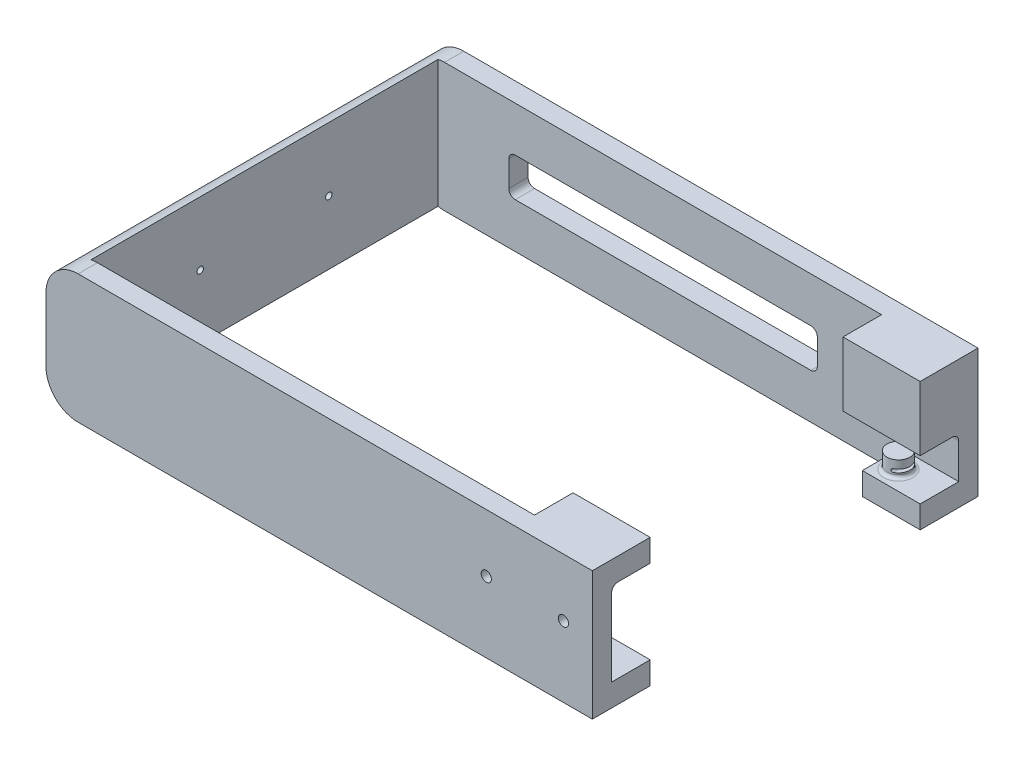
ISO-10303-21;
HEADER;
FILE_DESCRIPTION(('STEP AP214'),'2;1');
FILE_NAME('part.step','',(''),(''),'','','');
FILE_SCHEMA(('AUTOMOTIVE_DESIGN { 1 0 10303 214 1 1 1 1 }'));
ENDSEC;
DATA;
#1=APPLICATION_CONTEXT('core data for automotive mechanical design processes');
#2=APPLICATION_PROTOCOL_DEFINITION('international standard','automotive_design',2000,#1);
#3=PRODUCT_CONTEXT('',#1,'mechanical');
#4=PRODUCT('Part','Part','',(#3));
#5=PRODUCT_RELATED_PRODUCT_CATEGORY('part','',(#4));
#6=PRODUCT_DEFINITION_FORMATION('','',#4);
#7=PRODUCT_DEFINITION_CONTEXT('part definition',#1,'design');
#8=PRODUCT_DEFINITION('design','',#6,#7);
#9=PRODUCT_DEFINITION_SHAPE('','',#8);
#10=(LENGTH_UNIT() NAMED_UNIT(*) SI_UNIT(.MILLI.,.METRE.));
#11=(NAMED_UNIT(*) PLANE_ANGLE_UNIT() SI_UNIT($,.RADIAN.));
#12=(NAMED_UNIT(*) SI_UNIT($,.STERADIAN.) SOLID_ANGLE_UNIT());
#13=UNCERTAINTY_MEASURE_WITH_UNIT(LENGTH_MEASURE(1.E-05),#10,'distance_accuracy_value','');
#14=(GEOMETRIC_REPRESENTATION_CONTEXT(3) GLOBAL_UNCERTAINTY_ASSIGNED_CONTEXT((#13)) GLOBAL_UNIT_ASSIGNED_CONTEXT((#10,
#11,#12)) REPRESENTATION_CONTEXT('',''));
#15=CARTESIAN_POINT('',(0.,0.,0.));
#16=DIRECTION('',(0.,0.,1.));
#17=DIRECTION('',(1.,0.,0.));
#18=AXIS2_PLACEMENT_3D('',#15,#16,#17);
#19=CARTESIAN_POINT('',(33.4999999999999,3.5,57.));
#20=DIRECTION('',(0.,-1.,0.));
#21=DIRECTION('',(0.,0.,1.));
#22=AXIS2_PLACEMENT_3D('',#19,#20,#21);
#23=PLANE('',#22);
#24=CARTESIAN_POINT('',(36.1249999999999,3.5,54.));
#25=DIRECTION('',(0.,-1.,0.));
#26=DIRECTION('',(0.,0.,-1.));
#27=AXIS2_PLACEMENT_3D('',#24,#25,#26);
#28=CIRCLE('',#27,2.278);
#29=CARTESIAN_POINT('',(36.1249999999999,3.5,51.722));
#30=VERTEX_POINT('',#29);
#31=EDGE_CURVE('E635',#30,#30,#28,.T.);
#32=ORIENTED_EDGE('',*,*,#31,.T.);
#33=EDGE_LOOP('',(#32));
#34=FACE_BOUND('',#33,.T.);
#35=DIRECTION('',(-1.,0.,0.));
#36=VECTOR('',#35,1.);
#37=CARTESIAN_POINT('',(33.4999999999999,3.5,57.));
#38=LINE('',#37,#36);
#39=CARTESIAN_POINT('',(42.4999999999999,3.5,57.));
#40=VERTEX_POINT('',#39);
#41=CARTESIAN_POINT('',(32.4999999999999,3.5,57.));
#42=VERTEX_POINT('',#41);
#43=EDGE_CURVE('E789',#40,#42,#38,.T.);
#44=ORIENTED_EDGE('',*,*,#43,.F.);
#45=DIRECTION('',(0.,0.,1.));
#46=VECTOR('',#45,1.);
#47=CARTESIAN_POINT('',(42.4999999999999,3.5,57.));
#48=LINE('',#47,#46);
#49=CARTESIAN_POINT('',(42.4999999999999,3.5,51.));
#50=VERTEX_POINT('',#49);
#51=EDGE_CURVE('E791',#50,#40,#48,.T.);
#52=ORIENTED_EDGE('',*,*,#51,.F.);
#53=DIRECTION('',(1.,0.,0.));
#54=VECTOR('',#53,1.);
#55=CARTESIAN_POINT('',(42.4999999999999,3.5,51.));
#56=LINE('',#55,#54);
#57=CARTESIAN_POINT('',(33.4999999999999,3.5,51.));
#58=VERTEX_POINT('',#57);
#59=EDGE_CURVE('E794',#58,#50,#56,.T.);
#60=ORIENTED_EDGE('',*,*,#59,.F.);
#61=DIRECTION('',(0.,0.,-1.));
#62=VECTOR('',#61,1.);
#63=CARTESIAN_POINT('',(33.4999999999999,3.5,57.));
#64=LINE('',#63,#62);
#65=CARTESIAN_POINT('',(33.4999999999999,3.5,56.));
#66=VERTEX_POINT('',#65);
#67=EDGE_CURVE('E797',#66,#58,#64,.T.);
#68=ORIENTED_EDGE('',*,*,#67,.F.);
#69=CARTESIAN_POINT('',(32.4999999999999,3.5,56.));
#70=DIRECTION('',(0.,-1.,0.));
#71=DIRECTION('',(0.,0.,-1.));
#72=AXIS2_PLACEMENT_3D('',#69,#70,#71);
#73=CIRCLE('',#72,1.);
#74=EDGE_CURVE('E611',#66,#42,#73,.T.);
#75=ORIENTED_EDGE('',*,*,#74,.T.);
#76=EDGE_LOOP('',(#44,#52,#60,#68,#75));
#77=FACE_BOUND('',#76,.T.);
#78=ADVANCED_FACE('F26',(#34,#77),#23,.F.);
#79=CARTESIAN_POINT('',(33.4999999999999,3.5,3.));
#80=DIRECTION('',(0.,-1.,0.));
#81=DIRECTION('',(0.,0.,-1.));
#82=AXIS2_PLACEMENT_3D('',#79,#80,#81);
#83=PLANE('',#82);
#84=CARTESIAN_POINT('',(36.1249999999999,3.5,6.));
#85=DIRECTION('',(0.,-1.,0.));
#86=DIRECTION('',(0.,0.,-1.));
#87=AXIS2_PLACEMENT_3D('',#84,#85,#86);
#88=CIRCLE('',#87,2.278);
#89=CARTESIAN_POINT('',(36.1249999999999,3.5,3.722));
#90=VERTEX_POINT('',#89);
#91=EDGE_CURVE('E11',#90,#90,#88,.T.);
#92=ORIENTED_EDGE('',*,*,#91,.T.);
#93=EDGE_LOOP('',(#92));
#94=FACE_BOUND('',#93,.T.);
#95=DIRECTION('',(-1.,0.,0.));
#96=VECTOR('',#95,1.);
#97=CARTESIAN_POINT('',(33.4999999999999,3.5,3.));
#98=LINE('',#97,#96);
#99=CARTESIAN_POINT('',(42.4999999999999,3.5,3.));
#100=VERTEX_POINT('',#99);
#101=CARTESIAN_POINT('',(32.4999999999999,3.5,3.));
#102=VERTEX_POINT('',#101);
#103=EDGE_CURVE('E487',#100,#102,#98,.T.);
#104=ORIENTED_EDGE('',*,*,#103,.T.);
#105=CARTESIAN_POINT('',(32.4999999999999,3.5,4.));
#106=DIRECTION('',(0.,-1.,0.));
#107=DIRECTION('',(0.,0.,-1.));
#108=AXIS2_PLACEMENT_3D('',#105,#106,#107);
#109=CIRCLE('',#108,1.);
#110=CARTESIAN_POINT('',(33.4999999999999,3.5,4.));
#111=VERTEX_POINT('',#110);
#112=EDGE_CURVE('E607',#102,#111,#109,.T.);
#113=ORIENTED_EDGE('',*,*,#112,.T.);
#114=DIRECTION('',(0.,0.,1.));
#115=VECTOR('',#114,1.);
#116=CARTESIAN_POINT('',(33.4999999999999,3.5,3.));
#117=LINE('',#116,#115);
#118=CARTESIAN_POINT('',(33.4999999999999,3.49999999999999,9.00000000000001));
#119=VERTEX_POINT('',#118);
#120=EDGE_CURVE('E488',#111,#119,#117,.T.);
#121=ORIENTED_EDGE('',*,*,#120,.T.);
#122=DIRECTION('',(1.,0.,0.));
#123=VECTOR('',#122,1.);
#124=CARTESIAN_POINT('',(42.4999999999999,3.5,9.));
#125=LINE('',#124,#123);
#126=CARTESIAN_POINT('',(42.4999999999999,3.5,9.));
#127=VERTEX_POINT('',#126);
#128=EDGE_CURVE('E490',#119,#127,#125,.T.);
#129=ORIENTED_EDGE('',*,*,#128,.T.);
#130=DIRECTION('',(0.,0.,-1.));
#131=VECTOR('',#130,1.);
#132=CARTESIAN_POINT('',(42.4999999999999,3.5,3.));
#133=LINE('',#132,#131);
#134=EDGE_CURVE('E492',#127,#100,#133,.T.);
#135=ORIENTED_EDGE('',*,*,#134,.T.);
#136=EDGE_LOOP('',(#104,#113,#121,#129,#135));
#137=FACE_BOUND('',#136,.T.);
#138=ADVANCED_FACE('F361',(#94,#137),#83,.F.);
#139=CARTESIAN_POINT('',(-42.5,20.,3.));
#140=DIRECTION('',(0.,-1.,0.));
#141=DIRECTION('',(1.,0.,0.));
#142=AXIS2_PLACEMENT_3D('',#139,#140,#141);
#143=PLANE('',#142);
#144=DIRECTION('',(-1.,0.,0.));
#145=VECTOR('',#144,1.);
#146=CARTESIAN_POINT('',(-42.5,20.,0.));
#147=LINE('',#146,#145);
#148=CARTESIAN_POINT('',(42.4999999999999,20.,0.));
#149=VERTEX_POINT('',#148);
#150=CARTESIAN_POINT('',(-37.5,20.,0.));
#151=VERTEX_POINT('',#150);
#152=EDGE_CURVE('E506',#149,#151,#147,.T.);
#153=ORIENTED_EDGE('',*,*,#152,.T.);
#154=DIRECTION('',(0.,0.,-1.));
#155=VECTOR('',#154,1.);
#156=CARTESIAN_POINT('',(-37.5,20.,3.));
#157=LINE('',#156,#155);
#158=CARTESIAN_POINT('',(-37.5,20.,3.));
#159=VERTEX_POINT('',#158);
#160=EDGE_CURVE('E536',#151,#159,#157,.F.);
#161=ORIENTED_EDGE('',*,*,#160,.T.);
#162=DIRECTION('',(-1.,0.,0.));
#163=VECTOR('',#162,1.);
#164=CARTESIAN_POINT('',(-42.5,20.,3.));
#165=LINE('',#164,#163);
#166=CARTESIAN_POINT('',(30.4999999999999,20.,3.));
#167=VERTEX_POINT('',#166);
#168=EDGE_CURVE('E705',#167,#159,#165,.T.);
#169=ORIENTED_EDGE('',*,*,#168,.F.);
#170=DIRECTION('',(0.,0.,1.));
#171=VECTOR('',#170,1.);
#172=CARTESIAN_POINT('',(30.4999999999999,20.,3.));
#173=LINE('',#172,#171);
#174=CARTESIAN_POINT('',(30.5,20.,9.));
#175=VERTEX_POINT('',#174);
#176=EDGE_CURVE('E842',#167,#175,#173,.T.);
#177=ORIENTED_EDGE('',*,*,#176,.T.);
#178=DIRECTION('',(1.,0.,0.));
#179=VECTOR('',#178,1.);
#180=CARTESIAN_POINT('',(42.4999999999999,20.,9.));
#181=LINE('',#180,#179);
#182=CARTESIAN_POINT('',(42.4999999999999,20.,9.));
#183=VERTEX_POINT('',#182);
#184=EDGE_CURVE('E751',#175,#183,#181,.T.);
#185=ORIENTED_EDGE('',*,*,#184,.T.);
#186=DIRECTION('',(0.,0.,-1.));
#187=VECTOR('',#186,1.);
#188=CARTESIAN_POINT('',(42.4999999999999,20.,3.));
#189=LINE('',#188,#187);
#190=EDGE_CURVE('E714',#183,#149,#189,.T.);
#191=ORIENTED_EDGE('',*,*,#190,.T.);
#192=EDGE_LOOP('',(#153,#161,#169,#177,#185,#191));
#193=FACE_BOUND('',#192,.T.);
#194=ADVANCED_FACE('F367',(#193),#143,.F.);
#195=CARTESIAN_POINT('',(-42.5,0.,3.));
#196=DIRECTION('',(0.,1.,0.));
#197=DIRECTION('',(0.,0.,1.));
#198=AXIS2_PLACEMENT_3D('',#195,#196,#197);
#199=PLANE('',#198);
#200=DIRECTION('',(1.,0.,0.));
#201=VECTOR('',#200,1.);
#202=CARTESIAN_POINT('',(-42.5000000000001,0.,60.));
#203=LINE('',#202,#201);
#204=CARTESIAN_POINT('',(-37.5000000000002,0.,60.));
#205=VERTEX_POINT('',#204);
#206=CARTESIAN_POINT('',(42.4999999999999,0.,60.));
#207=VERTEX_POINT('',#206);
#208=EDGE_CURVE('E445',#205,#207,#203,.T.);
#209=ORIENTED_EDGE('',*,*,#208,.F.);
#210=DIRECTION('',(0.,0.,-1.));
#211=VECTOR('',#210,1.);
#212=CARTESIAN_POINT('',(-37.5,0.,3.));
#213=LINE('',#212,#211);
#214=CARTESIAN_POINT('',(-37.5000000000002,0.,57.));
#215=VERTEX_POINT('',#214);
#216=EDGE_CURVE('E448',#205,#215,#213,.T.);
#217=ORIENTED_EDGE('',*,*,#216,.T.);
#218=DIRECTION('',(1.,0.,0.));
#219=VECTOR('',#218,1.);
#220=CARTESIAN_POINT('',(-42.5000000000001,0.,57.));
#221=LINE('',#220,#219);
#222=CARTESIAN_POINT('',(32.4999999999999,0.,57.));
#223=VERTEX_POINT('',#222);
#224=EDGE_CURVE('E520',#215,#223,#221,.T.);
#225=ORIENTED_EDGE('',*,*,#224,.T.);
#226=CARTESIAN_POINT('',(32.4999999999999,0.,56.));
#227=DIRECTION('',(0.,1.,0.));
#228=DIRECTION('',(0.,0.,1.));
#229=AXIS2_PLACEMENT_3D('',#226,#227,#228);
#230=CIRCLE('',#229,1.);
#231=CARTESIAN_POINT('',(33.4999999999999,0.,56.));
#232=VERTEX_POINT('',#231);
#233=EDGE_CURVE('E609',#223,#232,#230,.T.);
#234=ORIENTED_EDGE('',*,*,#233,.T.);
#235=DIRECTION('',(0.,0.,-1.));
#236=VECTOR('',#235,1.);
#237=CARTESIAN_POINT('',(33.4999999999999,0.,57.));
#238=LINE('',#237,#236);
#239=CARTESIAN_POINT('',(33.4999999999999,0.,51.));
#240=VERTEX_POINT('',#239);
#241=EDGE_CURVE('E787',#232,#240,#238,.T.);
#242=ORIENTED_EDGE('',*,*,#241,.T.);
#243=DIRECTION('',(1.,0.,0.));
#244=VECTOR('',#243,1.);
#245=CARTESIAN_POINT('',(42.4999999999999,0.,51.));
#246=LINE('',#245,#244);
#247=CARTESIAN_POINT('',(42.4999999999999,0.,51.));
#248=VERTEX_POINT('',#247);
#249=EDGE_CURVE('E770',#240,#248,#246,.T.);
#250=ORIENTED_EDGE('',*,*,#249,.T.);
#251=DIRECTION('',(0.,0.,-1.));
#252=VECTOR('',#251,1.);
#253=CARTESIAN_POINT('',(42.4999999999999,0.,60.));
#254=LINE('',#253,#252);
#255=EDGE_CURVE('E451',#207,#248,#254,.T.);
#256=ORIENTED_EDGE('',*,*,#255,.F.);
#257=EDGE_LOOP('',(#209,#217,#225,#234,#242,#250,#256));
#258=FACE_BOUND('',#257,.T.);
#259=ADVANCED_FACE('F416',(#258),#199,.F.);
#260=CARTESIAN_POINT('',(-42.5,0.,3.));
#261=DIRECTION('',(0.,0.,1.));
#262=DIRECTION('',(1.,0.,0.));
#263=AXIS2_PLACEMENT_3D('',#260,#261,#262);
#264=PLANE('',#263);
#265=DIRECTION('',(0.,1.,0.));
#266=VECTOR('',#265,1.);
#267=CARTESIAN_POINT('',(42.4999999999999,20.,3.));
#268=LINE('',#267,#266);
#269=CARTESIAN_POINT('',(42.4999999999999,8.99999999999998,3.));
#270=VERTEX_POINT('',#269);
#271=EDGE_CURVE('E517',#100,#270,#268,.T.);
#272=ORIENTED_EDGE('',*,*,#271,.T.);
#273=DIRECTION('',(-1.,0.,0.));
#274=VECTOR('',#273,1.);
#275=CARTESIAN_POINT('',(30.4999999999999,9.,3.));
#276=LINE('',#275,#274);
#277=CARTESIAN_POINT('',(30.4999999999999,9.,3.));
#278=VERTEX_POINT('',#277);
#279=EDGE_CURVE('E541',#270,#278,#276,.T.);
#280=ORIENTED_EDGE('',*,*,#279,.T.);
#281=DIRECTION('',(0.,1.,0.));
#282=VECTOR('',#281,1.);
#283=CARTESIAN_POINT('',(30.4999999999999,9.99999999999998,3.));
#284=LINE('',#283,#282);
#285=EDGE_CURVE('E713',#278,#167,#284,.T.);
#286=ORIENTED_EDGE('',*,*,#285,.T.);
#287=ORIENTED_EDGE('',*,*,#168,.T.);
#288=CARTESIAN_POINT('',(-37.5,15.,3.));
#289=DIRECTION('',(0.,0.,1.));
#290=DIRECTION('',(1.,0.,0.));
#291=AXIS2_PLACEMENT_3D('',#288,#289,#290);
#292=CIRCLE('',#291,5.);
#293=CARTESIAN_POINT('',(-38.5,19.8989794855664,3.));
#294=VERTEX_POINT('',#293);
#295=EDGE_CURVE('E679',#159,#294,#292,.T.);
#296=ORIENTED_EDGE('',*,*,#295,.T.);
#297=DIRECTION('',(0.,1.,0.));
#298=VECTOR('',#297,1.);
#299=CARTESIAN_POINT('',(-38.5,20.,3.));
#300=LINE('',#299,#298);
#301=CARTESIAN_POINT('',(-38.5,0.10102051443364,3.));
#302=VERTEX_POINT('',#301);
#303=EDGE_CURVE('E475',#302,#294,#300,.T.);
#304=ORIENTED_EDGE('',*,*,#303,.F.);
#305=CARTESIAN_POINT('',(-37.5,4.99999999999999,3.));
#306=DIRECTION('',(0.,0.,1.));
#307=DIRECTION('',(1.,0.,0.));
#308=AXIS2_PLACEMENT_3D('',#305,#306,#307);
#309=CIRCLE('',#308,5.);
#310=CARTESIAN_POINT('',(-37.5,0.,3.));
#311=VERTEX_POINT('',#310);
#312=EDGE_CURVE('E678',#302,#311,#309,.T.);
#313=ORIENTED_EDGE('',*,*,#312,.T.);
#314=DIRECTION('',(1.,0.,0.));
#315=VECTOR('',#314,1.);
#316=CARTESIAN_POINT('',(-42.5,0.,3.));
#317=LINE('',#316,#315);
#318=CARTESIAN_POINT('',(32.4999999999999,0.,3.));
#319=VERTEX_POINT('',#318);
#320=EDGE_CURVE('E509',#311,#319,#317,.T.);
#321=ORIENTED_EDGE('',*,*,#320,.T.);
#322=DIRECTION('',(0.,-1.,0.));
#323=VECTOR('',#322,1.);
#324=CARTESIAN_POINT('',(32.4999999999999,0.,3.));
#325=LINE('',#324,#323);
#326=EDGE_CURVE('E538',#319,#102,#325,.F.);
#327=ORIENTED_EDGE('',*,*,#326,.T.);
#328=ORIENTED_EDGE('',*,*,#103,.F.);
#329=EDGE_LOOP('',(#272,#280,#286,#287,#296,#304,#313,#321,#327,#328));
#330=FACE_BOUND('',#329,.T.);
#331=DIRECTION('',(1.,0.,0.));
#332=VECTOR('',#331,1.);
#333=CARTESIAN_POINT('',(20.4999999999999,13.,3.));
#334=LINE('',#333,#332);
#335=CARTESIAN_POINT('',(-26.5,13.,3.));
#336=VERTEX_POINT('',#335);
#337=CARTESIAN_POINT('',(19.4999999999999,13.,3.));
#338=VERTEX_POINT('',#337);
#339=EDGE_CURVE('E781',#336,#338,#334,.T.);
#340=ORIENTED_EDGE('',*,*,#339,.T.);
#341=CARTESIAN_POINT('',(19.4999999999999,12.,3.));
#342=DIRECTION('',(0.,0.,1.));
#343=DIRECTION('',(1.,0.,0.));
#344=AXIS2_PLACEMENT_3D('',#341,#342,#343);
#345=CIRCLE('',#344,1.);
#346=CARTESIAN_POINT('',(20.4999999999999,12.,3.));
#347=VERTEX_POINT('',#346);
#348=EDGE_CURVE('E591',#338,#347,#345,.F.);
#349=ORIENTED_EDGE('',*,*,#348,.T.);
#350=DIRECTION('',(0.,-1.,0.));
#351=VECTOR('',#350,1.);
#352=CARTESIAN_POINT('',(20.4999999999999,13.,3.));
#353=LINE('',#352,#351);
#354=CARTESIAN_POINT('',(20.4999999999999,8.,3.));
#355=VERTEX_POINT('',#354);
#356=EDGE_CURVE('E758',#347,#355,#353,.T.);
#357=ORIENTED_EDGE('',*,*,#356,.T.);
#358=CARTESIAN_POINT('',(19.4999999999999,8.,3.));
#359=DIRECTION('',(0.,0.,1.));
#360=DIRECTION('',(1.,0.,0.));
#361=AXIS2_PLACEMENT_3D('',#358,#359,#360);
#362=CIRCLE('',#361,1.);
#363=CARTESIAN_POINT('',(19.4999999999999,6.99999999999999,3.));
#364=VERTEX_POINT('',#363);
#365=EDGE_CURVE('E603',#355,#364,#362,.F.);
#366=ORIENTED_EDGE('',*,*,#365,.T.);
#367=DIRECTION('',(-1.,0.,0.));
#368=VECTOR('',#367,1.);
#369=CARTESIAN_POINT('',(20.4999999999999,6.99999999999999,3.));
#370=LINE('',#369,#368);
#371=CARTESIAN_POINT('',(-26.5,6.99999999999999,3.));
#372=VERTEX_POINT('',#371);
#373=EDGE_CURVE('E762',#364,#372,#370,.T.);
#374=ORIENTED_EDGE('',*,*,#373,.T.);
#375=CARTESIAN_POINT('',(-26.5,8.,3.));
#376=DIRECTION('',(0.,0.,1.));
#377=DIRECTION('',(1.,0.,0.));
#378=AXIS2_PLACEMENT_3D('',#375,#376,#377);
#379=CIRCLE('',#378,1.);
#380=CARTESIAN_POINT('',(-27.5,8.,3.));
#381=VERTEX_POINT('',#380);
#382=EDGE_CURVE('E599',#372,#381,#379,.F.);
#383=ORIENTED_EDGE('',*,*,#382,.T.);
#384=DIRECTION('',(0.,1.,0.));
#385=VECTOR('',#384,1.);
#386=CARTESIAN_POINT('',(-27.5,13.,3.));
#387=LINE('',#386,#385);
#388=CARTESIAN_POINT('',(-27.5,12.,3.));
#389=VERTEX_POINT('',#388);
#390=EDGE_CURVE('E766',#381,#389,#387,.T.);
#391=ORIENTED_EDGE('',*,*,#390,.T.);
#392=CARTESIAN_POINT('',(-26.5,12.,3.));
#393=DIRECTION('',(0.,0.,1.));
#394=DIRECTION('',(1.,0.,0.));
#395=AXIS2_PLACEMENT_3D('',#392,#393,#394);
#396=CIRCLE('',#395,1.);
#397=EDGE_CURVE('E595',#389,#336,#396,.F.);
#398=ORIENTED_EDGE('',*,*,#397,.T.);
#399=EDGE_LOOP('',(#340,#349,#357,#366,#374,#383,#391,#398));
#400=FACE_BOUND('',#399,.T.);
#401=ADVANCED_FACE('F413',(#330,#400),#264,.T.);
#402=CARTESIAN_POINT('',(-42.5,20.,3.));
#403=DIRECTION('',(1.,0.,0.));
#404=DIRECTION('',(0.,1.,0.));
#405=AXIS2_PLACEMENT_3D('',#402,#403,#404);
#406=PLANE('',#405);
#407=CARTESIAN_POINT('',(-42.5,10.0000000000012,19.9999999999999));
#408=DIRECTION('',(-1.,0.,0.));
#409=DIRECTION('',(0.,-1.,0.));
#410=AXIS2_PLACEMENT_3D('',#407,#408,#409);
#411=CIRCLE('',#410,0.499999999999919);
#412=CARTESIAN_POINT('',(-42.5,9.5000000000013,19.9999999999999));
#413=VERTEX_POINT('',#412);
#414=EDGE_CURVE('E665',#413,#413,#411,.T.);
#415=ORIENTED_EDGE('',*,*,#414,.F.);
#416=EDGE_LOOP('',(#415));
#417=FACE_BOUND('',#416,.T.);
#418=CARTESIAN_POINT('',(-42.5,10.0000000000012,40.0000000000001));
#419=DIRECTION('',(-1.,0.,0.));
#420=DIRECTION('',(0.,-1.,0.));
#421=AXIS2_PLACEMENT_3D('',#418,#419,#420);
#422=CIRCLE('',#421,0.499999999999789);
#423=CARTESIAN_POINT('',(-42.5,9.5000000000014,40.0000000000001));
#424=VERTEX_POINT('',#423);
#425=EDGE_CURVE('E625',#424,#424,#422,.T.);
#426=ORIENTED_EDGE('',*,*,#425,.F.);
#427=EDGE_LOOP('',(#426));
#428=FACE_BOUND('',#427,.T.);
#429=DIRECTION('',(0.,-1.,0.));
#430=VECTOR('',#429,1.);
#431=CARTESIAN_POINT('',(-42.5,20.,0.));
#432=LINE('',#431,#430);
#433=CARTESIAN_POINT('',(-42.5,15.,0.));
#434=VERTEX_POINT('',#433);
#435=CARTESIAN_POINT('',(-42.5,5.,0.));
#436=VERTEX_POINT('',#435);
#437=EDGE_CURVE('E499',#434,#436,#432,.T.);
#438=ORIENTED_EDGE('',*,*,#437,.T.);
#439=DIRECTION('',(0.,0.,-1.));
#440=VECTOR('',#439,1.);
#441=CARTESIAN_POINT('',(-42.5,5.,3.));
#442=LINE('',#441,#440);
#443=CARTESIAN_POINT('',(-42.5000000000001,5.,60.));
#444=VERTEX_POINT('',#443);
#445=EDGE_CURVE('E692',#436,#444,#442,.F.);
#446=ORIENTED_EDGE('',*,*,#445,.T.);
#447=DIRECTION('',(0.,-1.,0.));
#448=VECTOR('',#447,1.);
#449=CARTESIAN_POINT('',(-42.5000000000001,0.,60.));
#450=LINE('',#449,#448);
#451=CARTESIAN_POINT('',(-42.5000000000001,15.,60.));
#452=VERTEX_POINT('',#451);
#453=EDGE_CURVE('E455',#452,#444,#450,.T.);
#454=ORIENTED_EDGE('',*,*,#453,.F.);
#455=DIRECTION('',(0.,0.,-1.));
#456=VECTOR('',#455,1.);
#457=CARTESIAN_POINT('',(-42.5,15.,3.));
#458=LINE('',#457,#456);
#459=EDGE_CURVE('E689',#452,#434,#458,.T.);
#460=ORIENTED_EDGE('',*,*,#459,.T.);
#461=EDGE_LOOP('',(#438,#446,#454,#460));
#462=FACE_BOUND('',#461,.T.);
#463=ADVANCED_FACE('F28',(#417,#428,#462),#406,.F.);
#464=ORIENTED_EDGE('',*,*,#320,.F.);
#465=DIRECTION('',(0.,0.,-1.));
#466=VECTOR('',#465,1.);
#467=CARTESIAN_POINT('',(-37.5,0.,3.));
#468=LINE('',#467,#466);
#469=CARTESIAN_POINT('',(-37.5,0.,0.));
#470=VERTEX_POINT('',#469);
#471=EDGE_CURVE('E464',#311,#470,#468,.T.);
#472=ORIENTED_EDGE('',*,*,#471,.T.);
#473=DIRECTION('',(1.,0.,0.));
#474=VECTOR('',#473,1.);
#475=CARTESIAN_POINT('',(-42.5,0.,0.));
#476=LINE('',#475,#474);
#477=CARTESIAN_POINT('',(42.4999999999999,0.,0.));
#478=VERTEX_POINT('',#477);
#479=EDGE_CURVE('E502',#470,#478,#476,.T.);
#480=ORIENTED_EDGE('',*,*,#479,.T.);
#481=DIRECTION('',(0.,0.,-1.));
#482=VECTOR('',#481,1.);
#483=CARTESIAN_POINT('',(42.4999999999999,0.,3.));
#484=LINE('',#483,#482);
#485=CARTESIAN_POINT('',(42.4999999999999,0.,9.));
#486=VERTEX_POINT('',#485);
#487=EDGE_CURVE('E468',#486,#478,#484,.T.);
#488=ORIENTED_EDGE('',*,*,#487,.F.);
#489=DIRECTION('',(1.,0.,0.));
#490=VECTOR('',#489,1.);
#491=CARTESIAN_POINT('',(42.4999999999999,0.,9.));
#492=LINE('',#491,#490);
#493=CARTESIAN_POINT('',(33.4999999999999,0.,9.00000000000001));
#494=VERTEX_POINT('',#493);
#495=EDGE_CURVE('E484',#494,#486,#492,.T.);
#496=ORIENTED_EDGE('',*,*,#495,.F.);
#497=DIRECTION('',(0.,0.,1.));
#498=VECTOR('',#497,1.);
#499=CARTESIAN_POINT('',(33.4999999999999,0.,3.));
#500=LINE('',#499,#498);
#501=CARTESIAN_POINT('',(33.4999999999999,0.,4.));
#502=VERTEX_POINT('',#501);
#503=EDGE_CURVE('E483',#502,#494,#500,.T.);
#504=ORIENTED_EDGE('',*,*,#503,.F.);
#505=CARTESIAN_POINT('',(32.4999999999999,0.,4.));
#506=DIRECTION('',(0.,1.,0.));
#507=DIRECTION('',(0.,0.,1.));
#508=AXIS2_PLACEMENT_3D('',#505,#506,#507);
#509=CIRCLE('',#508,1.);
#510=EDGE_CURVE('E605',#502,#319,#509,.T.);
#511=ORIENTED_EDGE('',*,*,#510,.T.);
#512=EDGE_LOOP('',(#464,#472,#480,#488,#496,#504,#511));
#513=FACE_BOUND('',#512,.T.);
#514=ADVANCED_FACE('F423',(#513),#199,.F.);
#515=CARTESIAN_POINT('',(42.4999999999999,20.,3.));
#516=DIRECTION('',(-1.,0.,0.));
#517=DIRECTION('',(0.,0.,1.));
#518=AXIS2_PLACEMENT_3D('',#515,#516,#517);
#519=PLANE('',#518);
#520=DIRECTION('',(0.,1.,0.));
#521=VECTOR('',#520,1.);
#522=CARTESIAN_POINT('',(42.4999999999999,20.,0.));
#523=LINE('',#522,#521);
#524=EDGE_CURVE('E504',#478,#149,#523,.T.);
#525=ORIENTED_EDGE('',*,*,#524,.T.);
#526=ORIENTED_EDGE('',*,*,#190,.F.);
#527=DIRECTION('',(0.,1.,0.));
#528=VECTOR('',#527,1.);
#529=CARTESIAN_POINT('',(42.4999999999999,9.99999999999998,9.));
#530=LINE('',#529,#528);
#531=CARTESIAN_POINT('',(42.4999999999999,9.99999999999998,9.));
#532=VERTEX_POINT('',#531);
#533=EDGE_CURVE('E755',#532,#183,#530,.T.);
#534=ORIENTED_EDGE('',*,*,#533,.F.);
#535=DIRECTION('',(0.,0.,-1.));
#536=VECTOR('',#535,1.);
#537=CARTESIAN_POINT('',(42.4999999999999,9.99999999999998,2.99999999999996));
#538=LINE('',#537,#536);
#539=CARTESIAN_POINT('',(42.4999999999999,9.99999999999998,4.));
#540=VERTEX_POINT('',#539);
#541=EDGE_CURVE('E748',#532,#540,#538,.T.);
#542=ORIENTED_EDGE('',*,*,#541,.T.);
#543=CARTESIAN_POINT('',(42.4999999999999,8.99999999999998,4.));
#544=DIRECTION('',(-1.,0.,0.));
#545=DIRECTION('',(0.,0.,1.));
#546=AXIS2_PLACEMENT_3D('',#543,#544,#545);
#547=CIRCLE('',#546,1.);
#548=EDGE_CURVE('E582',#540,#270,#547,.T.);
#549=ORIENTED_EDGE('',*,*,#548,.T.);
#550=ORIENTED_EDGE('',*,*,#271,.F.);
#551=ORIENTED_EDGE('',*,*,#134,.F.);
#552=DIRECTION('',(0.,-1.,0.));
#553=VECTOR('',#552,1.);
#554=CARTESIAN_POINT('',(42.4999999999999,3.5,9.));
#555=LINE('',#554,#553);
#556=EDGE_CURVE('E493',#127,#486,#555,.T.);
#557=ORIENTED_EDGE('',*,*,#556,.T.);
#558=ORIENTED_EDGE('',*,*,#487,.T.);
#559=EDGE_LOOP('',(#525,#526,#534,#542,#549,#550,#551,#557,#558));
#560=FACE_BOUND('',#559,.T.);
#561=ADVANCED_FACE('F420',(#560),#519,.F.);
#562=DIRECTION('',(0.,0.,-1.));
#563=VECTOR('',#562,1.);
#564=CARTESIAN_POINT('',(42.4999999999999,20.,60.));
#565=LINE('',#564,#563);
#566=CARTESIAN_POINT('',(42.4999999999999,20.,60.));
#567=VERTEX_POINT('',#566);
#568=CARTESIAN_POINT('',(42.4999999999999,20.,51.));
#569=VERTEX_POINT('',#568);
#570=EDGE_CURVE('E869',#567,#569,#565,.T.);
#571=ORIENTED_EDGE('',*,*,#570,.T.);
#572=DIRECTION('',(-1.,0.,0.));
#573=VECTOR('',#572,1.);
#574=CARTESIAN_POINT('',(42.4999999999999,20.,51.));
#575=LINE('',#574,#573);
#576=CARTESIAN_POINT('',(30.4999999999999,20.,51.));
#577=VERTEX_POINT('',#576);
#578=EDGE_CURVE('E835',#569,#577,#575,.T.);
#579=ORIENTED_EDGE('',*,*,#578,.T.);
#580=DIRECTION('',(0.,0.,1.));
#581=VECTOR('',#580,1.);
#582=CARTESIAN_POINT('',(30.5,20.,57.));
#583=LINE('',#582,#581);
#584=CARTESIAN_POINT('',(30.5,20.,57.));
#585=VERTEX_POINT('',#584);
#586=EDGE_CURVE('E831',#577,#585,#583,.T.);
#587=ORIENTED_EDGE('',*,*,#586,.T.);
#588=DIRECTION('',(-1.,0.,0.));
#589=VECTOR('',#588,1.);
#590=CARTESIAN_POINT('',(-42.5000000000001,20.,57.));
#591=LINE('',#590,#589);
#592=CARTESIAN_POINT('',(-37.5000000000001,20.,57.));
#593=VERTEX_POINT('',#592);
#594=EDGE_CURVE('E530',#585,#593,#591,.T.);
#595=ORIENTED_EDGE('',*,*,#594,.T.);
#596=DIRECTION('',(0.,0.,-1.));
#597=VECTOR('',#596,1.);
#598=CARTESIAN_POINT('',(-37.5,20.,3.));
#599=LINE('',#598,#597);
#600=CARTESIAN_POINT('',(-37.5000000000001,20.,60.));
#601=VERTEX_POINT('',#600);
#602=EDGE_CURVE('E696',#593,#601,#599,.F.);
#603=ORIENTED_EDGE('',*,*,#602,.T.);
#604=DIRECTION('',(-1.,0.,0.));
#605=VECTOR('',#604,1.);
#606=CARTESIAN_POINT('',(-42.5000000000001,20.,60.));
#607=LINE('',#606,#605);
#608=EDGE_CURVE('E860',#567,#601,#607,.T.);
#609=ORIENTED_EDGE('',*,*,#608,.F.);
#610=EDGE_LOOP('',(#571,#579,#587,#595,#603,#609));
#611=FACE_BOUND('',#610,.T.);
#612=ADVANCED_FACE('F411',(#611),#143,.F.);
#613=CARTESIAN_POINT('',(-42.5,0.,0.));
#614=DIRECTION('',(0.,0.,1.));
#615=DIRECTION('',(1.,0.,0.));
#616=AXIS2_PLACEMENT_3D('',#613,#614,#615);
#617=PLANE('',#616);
#618=DIRECTION('',(-1.,0.,0.));
#619=VECTOR('',#618,1.);
#620=CARTESIAN_POINT('',(20.4999999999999,6.99999999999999,0.));
#621=LINE('',#620,#619);
#622=CARTESIAN_POINT('',(19.4999999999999,6.99999999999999,0.));
#623=VERTEX_POINT('',#622);
#624=CARTESIAN_POINT('',(-26.5,6.99999999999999,0.));
#625=VERTEX_POINT('',#624);
#626=EDGE_CURVE('E774',#623,#625,#621,.T.);
#627=ORIENTED_EDGE('',*,*,#626,.F.);
#628=CARTESIAN_POINT('',(19.4999999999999,8.,0.));
#629=DIRECTION('',(0.,0.,1.));
#630=DIRECTION('',(1.,0.,0.));
#631=AXIS2_PLACEMENT_3D('',#628,#629,#630);
#632=CIRCLE('',#631,1.);
#633=CARTESIAN_POINT('',(20.4999999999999,8.,0.));
#634=VERTEX_POINT('',#633);
#635=EDGE_CURVE('E601',#623,#634,#632,.T.);
#636=ORIENTED_EDGE('',*,*,#635,.T.);
#637=DIRECTION('',(0.,-1.,0.));
#638=VECTOR('',#637,1.);
#639=CARTESIAN_POINT('',(20.4999999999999,13.,0.));
#640=LINE('',#639,#638);
#641=CARTESIAN_POINT('',(20.4999999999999,12.,0.));
#642=VERTEX_POINT('',#641);
#643=EDGE_CURVE('E765',#642,#634,#640,.T.);
#644=ORIENTED_EDGE('',*,*,#643,.F.);
#645=CARTESIAN_POINT('',(19.4999999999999,12.,0.));
#646=DIRECTION('',(0.,0.,1.));
#647=DIRECTION('',(1.,0.,0.));
#648=AXIS2_PLACEMENT_3D('',#645,#646,#647);
#649=CIRCLE('',#648,1.);
#650=CARTESIAN_POINT('',(19.4999999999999,13.,0.));
#651=VERTEX_POINT('',#650);
#652=EDGE_CURVE('E589',#642,#651,#649,.T.);
#653=ORIENTED_EDGE('',*,*,#652,.T.);
#654=DIRECTION('',(1.,0.,0.));
#655=VECTOR('',#654,1.);
#656=CARTESIAN_POINT('',(20.4999999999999,13.,0.));
#657=LINE('',#656,#655);
#658=CARTESIAN_POINT('',(-26.5,13.,0.));
#659=VERTEX_POINT('',#658);
#660=EDGE_CURVE('E767',#659,#651,#657,.T.);
#661=ORIENTED_EDGE('',*,*,#660,.F.);
#662=CARTESIAN_POINT('',(-26.5,12.,0.));
#663=DIRECTION('',(0.,0.,1.));
#664=DIRECTION('',(1.,0.,0.));
#665=AXIS2_PLACEMENT_3D('',#662,#663,#664);
#666=CIRCLE('',#665,1.);
#667=CARTESIAN_POINT('',(-27.5,12.,0.));
#668=VERTEX_POINT('',#667);
#669=EDGE_CURVE('E593',#659,#668,#666,.T.);
#670=ORIENTED_EDGE('',*,*,#669,.T.);
#671=DIRECTION('',(0.,1.,0.));
#672=VECTOR('',#671,1.);
#673=CARTESIAN_POINT('',(-27.5,13.,0.));
#674=LINE('',#673,#672);
#675=CARTESIAN_POINT('',(-27.5,8.,0.));
#676=VERTEX_POINT('',#675);
#677=EDGE_CURVE('E771',#676,#668,#674,.T.);
#678=ORIENTED_EDGE('',*,*,#677,.F.);
#679=CARTESIAN_POINT('',(-26.5,8.,0.));
#680=DIRECTION('',(0.,0.,1.));
#681=DIRECTION('',(1.,0.,0.));
#682=AXIS2_PLACEMENT_3D('',#679,#680,#681);
#683=CIRCLE('',#682,1.);
#684=EDGE_CURVE('E597',#676,#625,#683,.T.);
#685=ORIENTED_EDGE('',*,*,#684,.T.);
#686=EDGE_LOOP('',(#627,#636,#644,#653,#661,#670,#678,#685));
#687=FACE_BOUND('',#686,.T.);
#688=ORIENTED_EDGE('',*,*,#479,.F.);
#689=CARTESIAN_POINT('',(-37.5,4.99999999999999,0.));
#690=DIRECTION('',(0.,0.,1.));
#691=DIRECTION('',(1.,0.,0.));
#692=AXIS2_PLACEMENT_3D('',#689,#690,#691);
#693=CIRCLE('',#692,5.);
#694=EDGE_CURVE('E687',#470,#436,#693,.F.);
#695=ORIENTED_EDGE('',*,*,#694,.T.);
#696=ORIENTED_EDGE('',*,*,#437,.F.);
#697=CARTESIAN_POINT('',(-37.5,15.,0.));
#698=DIRECTION('',(0.,0.,1.));
#699=DIRECTION('',(1.,0.,0.));
#700=AXIS2_PLACEMENT_3D('',#697,#698,#699);
#701=CIRCLE('',#700,5.);
#702=EDGE_CURVE('E685',#434,#151,#701,.F.);
#703=ORIENTED_EDGE('',*,*,#702,.T.);
#704=ORIENTED_EDGE('',*,*,#152,.F.);
#705=ORIENTED_EDGE('',*,*,#524,.F.);
#706=EDGE_LOOP('',(#688,#695,#696,#703,#704,#705));
#707=FACE_BOUND('',#706,.T.);
#708=ADVANCED_FACE('F407',(#687,#707),#617,.F.);
#709=CARTESIAN_POINT('',(33.4999999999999,3.5,3.));
#710=DIRECTION('',(1.,0.,0.));
#711=DIRECTION('',(0.,0.,-1.));
#712=AXIS2_PLACEMENT_3D('',#709,#710,#711);
#713=PLANE('',#712);
#714=ORIENTED_EDGE('',*,*,#120,.F.);
#715=DIRECTION('',(0.,-1.,0.));
#716=VECTOR('',#715,1.);
#717=CARTESIAN_POINT('',(33.4999999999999,3.5,4.));
#718=LINE('',#717,#716);
#719=EDGE_CURVE('E574',#111,#502,#718,.T.);
#720=ORIENTED_EDGE('',*,*,#719,.T.);
#721=ORIENTED_EDGE('',*,*,#503,.T.);
#722=DIRECTION('',(0.,-1.,0.));
#723=VECTOR('',#722,1.);
#724=CARTESIAN_POINT('',(33.4999999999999,3.49999999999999,9.00000000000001));
#725=LINE('',#724,#723);
#726=EDGE_CURVE('E496',#119,#494,#725,.T.);
#727=ORIENTED_EDGE('',*,*,#726,.F.);
#728=EDGE_LOOP('',(#714,#720,#721,#727));
#729=FACE_BOUND('',#728,.T.);
#730=ADVANCED_FACE('F403',(#729),#713,.F.);
#731=CARTESIAN_POINT('',(42.4999999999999,3.5,9.));
#732=DIRECTION('',(0.,0.,-1.));
#733=DIRECTION('',(-1.,0.,0.));
#734=AXIS2_PLACEMENT_3D('',#731,#732,#733);
#735=PLANE('',#734);
#736=ORIENTED_EDGE('',*,*,#495,.T.);
#737=ORIENTED_EDGE('',*,*,#556,.F.);
#738=ORIENTED_EDGE('',*,*,#128,.F.);
#739=ORIENTED_EDGE('',*,*,#726,.T.);
#740=EDGE_LOOP('',(#736,#737,#738,#739));
#741=FACE_BOUND('',#740,.T.);
#742=ADVANCED_FACE('F398',(#741),#735,.F.);
#743=CARTESIAN_POINT('',(-38.5,20.,30.));
#744=DIRECTION('',(-1.,0.,0.));
#745=DIRECTION('',(0.,0.,1.));
#746=AXIS2_PLACEMENT_3D('',#743,#744,#745);
#747=PLANE('',#746);
#748=CARTESIAN_POINT('',(-38.5,10.0000000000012,19.9999999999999));
#749=DIRECTION('',(-1.,0.,0.));
#750=DIRECTION('',(0.,0.,1.));
#751=AXIS2_PLACEMENT_3D('',#748,#749,#750);
#752=CIRCLE('',#751,0.499999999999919);
#753=CARTESIAN_POINT('',(-38.5,10.0000000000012,20.4999999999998));
#754=VERTEX_POINT('',#753);
#755=EDGE_CURVE('E30',#754,#754,#752,.T.);
#756=ORIENTED_EDGE('',*,*,#755,.T.);
#757=EDGE_LOOP('',(#756));
#758=FACE_BOUND('',#757,.T.);
#759=CARTESIAN_POINT('',(-38.5,10.0000000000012,40.0000000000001));
#760=DIRECTION('',(-1.,0.,0.));
#761=DIRECTION('',(0.,0.,1.));
#762=AXIS2_PLACEMENT_3D('',#759,#760,#761);
#763=CIRCLE('',#762,0.499999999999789);
#764=CARTESIAN_POINT('',(-38.5,10.0000000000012,40.4999999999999));
#765=VERTEX_POINT('',#764);
#766=EDGE_CURVE('E627',#765,#765,#763,.T.);
#767=ORIENTED_EDGE('',*,*,#766,.T.);
#768=EDGE_LOOP('',(#767));
#769=FACE_BOUND('',#768,.T.);
#770=DIRECTION('',(0.,1.,0.));
#771=VECTOR('',#770,1.);
#772=CARTESIAN_POINT('',(-38.5000000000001,20.,57.));
#773=LINE('',#772,#771);
#774=CARTESIAN_POINT('',(-38.5000000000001,0.101020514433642,57.));
#775=VERTEX_POINT('',#774);
#776=CARTESIAN_POINT('',(-38.5000000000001,19.8989794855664,57.));
#777=VERTEX_POINT('',#776);
#778=EDGE_CURVE('E472',#775,#777,#773,.T.);
#779=ORIENTED_EDGE('',*,*,#778,.F.);
#780=DIRECTION('',(0.,0.,-1.));
#781=VECTOR('',#780,1.);
#782=CARTESIAN_POINT('',(-38.5000000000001,0.101020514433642,57.));
#783=LINE('',#782,#781);
#784=EDGE_CURVE('E670',#775,#302,#783,.T.);
#785=ORIENTED_EDGE('',*,*,#784,.T.);
#786=ORIENTED_EDGE('',*,*,#303,.T.);
#787=DIRECTION('',(0.,0.,-1.));
#788=VECTOR('',#787,1.);
#789=CARTESIAN_POINT('',(-38.5,19.8989794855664,3.));
#790=LINE('',#789,#788);
#791=EDGE_CURVE('E673',#294,#777,#790,.F.);
#792=ORIENTED_EDGE('',*,*,#791,.T.);
#793=EDGE_LOOP('',(#779,#785,#786,#792));
#794=FACE_BOUND('',#793,.T.);
#795=ADVANCED_FACE('F395',(#758,#769,#794),#747,.F.);
#796=CARTESIAN_POINT('',(42.4999999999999,0.,60.));
#797=DIRECTION('',(-1.,0.,0.));
#798=DIRECTION('',(0.,0.,1.));
#799=AXIS2_PLACEMENT_3D('',#796,#797,#798);
#800=PLANE('',#799);
#801=ORIENTED_EDGE('',*,*,#255,.T.);
#802=DIRECTION('',(0.,-1.,0.));
#803=VECTOR('',#802,1.);
#804=CARTESIAN_POINT('',(42.4999999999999,3.5,51.));
#805=LINE('',#804,#803);
#806=EDGE_CURVE('E523',#50,#248,#805,.T.);
#807=ORIENTED_EDGE('',*,*,#806,.F.);
#808=ORIENTED_EDGE('',*,*,#51,.T.);
#809=DIRECTION('',(0.,1.,0.));
#810=VECTOR('',#809,1.);
#811=CARTESIAN_POINT('',(42.4999999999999,0.,57.));
#812=LINE('',#811,#810);
#813=CARTESIAN_POINT('',(42.4999999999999,15.5,57.));
#814=VERTEX_POINT('',#813);
#815=EDGE_CURVE('E522',#40,#814,#812,.T.);
#816=ORIENTED_EDGE('',*,*,#815,.T.);
#817=CARTESIAN_POINT('',(42.4999999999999,15.5,56.));
#818=DIRECTION('',(-1.,0.,0.));
#819=DIRECTION('',(0.,0.,1.));
#820=AXIS2_PLACEMENT_3D('',#817,#818,#819);
#821=CIRCLE('',#820,1.);
#822=CARTESIAN_POINT('',(42.4999999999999,16.5,56.));
#823=VERTEX_POINT('',#822);
#824=EDGE_CURVE('E584',#814,#823,#821,.T.);
#825=ORIENTED_EDGE('',*,*,#824,.T.);
#826=DIRECTION('',(0.,0.,-1.));
#827=VECTOR('',#826,1.);
#828=CARTESIAN_POINT('',(42.4999999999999,16.5,57.));
#829=LINE('',#828,#827);
#830=CARTESIAN_POINT('',(42.4999999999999,16.5,51.));
#831=VERTEX_POINT('',#830);
#832=EDGE_CURVE('E822',#823,#831,#829,.T.);
#833=ORIENTED_EDGE('',*,*,#832,.T.);
#834=DIRECTION('',(0.,1.,0.));
#835=VECTOR('',#834,1.);
#836=CARTESIAN_POINT('',(42.4999999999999,16.5,51.));
#837=LINE('',#836,#835);
#838=EDGE_CURVE('E840',#831,#569,#837,.T.);
#839=ORIENTED_EDGE('',*,*,#838,.T.);
#840=ORIENTED_EDGE('',*,*,#570,.F.);
#841=DIRECTION('',(0.,1.,0.));
#842=VECTOR('',#841,1.);
#843=CARTESIAN_POINT('',(42.4999999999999,0.,60.));
#844=LINE('',#843,#842);
#845=EDGE_CURVE('E454',#207,#567,#844,.T.);
#846=ORIENTED_EDGE('',*,*,#845,.F.);
#847=EDGE_LOOP('',(#801,#807,#808,#816,#825,#833,#839,#840,#846));
#848=FACE_BOUND('',#847,.T.);
#849=ADVANCED_FACE('F391',(#848),#800,.F.);
#850=CARTESIAN_POINT('',(-42.5000000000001,20.,60.));
#851=DIRECTION('',(0.,0.,-1.));
#852=DIRECTION('',(-1.,0.,0.));
#853=AXIS2_PLACEMENT_3D('',#850,#851,#852);
#854=PLANE('',#853);
#855=CARTESIAN_POINT('',(26.,11.,60.));
#856=DIRECTION('',(0.,0.,-1.));
#857=DIRECTION('',(-1.,0.,0.));
#858=AXIS2_PLACEMENT_3D('',#855,#856,#857);
#859=CIRCLE('',#858,0.793749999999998);
#860=CARTESIAN_POINT('',(25.20625,11.,60.));
#861=VERTEX_POINT('',#860);
#862=EDGE_CURVE('E879',#861,#861,#859,.T.);
#863=ORIENTED_EDGE('',*,*,#862,.T.);
#864=EDGE_LOOP('',(#863));
#865=FACE_BOUND('',#864,.T.);
#866=CARTESIAN_POINT('',(37.9999999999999,11.,60.));
#867=DIRECTION('',(0.,0.,-1.));
#868=DIRECTION('',(-1.,0.,0.));
#869=AXIS2_PLACEMENT_3D('',#866,#867,#868);
#870=CIRCLE('',#869,0.793749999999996);
#871=CARTESIAN_POINT('',(37.2062499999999,11.,60.));
#872=VERTEX_POINT('',#871);
#873=EDGE_CURVE('E872',#872,#872,#870,.T.);
#874=ORIENTED_EDGE('',*,*,#873,.T.);
#875=EDGE_LOOP('',(#874));
#876=FACE_BOUND('',#875,.T.);
#877=ORIENTED_EDGE('',*,*,#453,.T.);
#878=CARTESIAN_POINT('',(-37.5000000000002,4.99999999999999,60.));
#879=DIRECTION('',(0.,0.,-1.));
#880=DIRECTION('',(-1.,0.,0.));
#881=AXIS2_PLACEMENT_3D('',#878,#879,#880);
#882=CIRCLE('',#881,5.);
#883=EDGE_CURVE('E460',#444,#205,#882,.F.);
#884=ORIENTED_EDGE('',*,*,#883,.T.);
#885=ORIENTED_EDGE('',*,*,#208,.T.);
#886=ORIENTED_EDGE('',*,*,#845,.T.);
#887=ORIENTED_EDGE('',*,*,#608,.T.);
#888=CARTESIAN_POINT('',(-37.5000000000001,15.,60.));
#889=DIRECTION('',(0.,0.,-1.));
#890=DIRECTION('',(-1.,0.,0.));
#891=AXIS2_PLACEMENT_3D('',#888,#889,#890);
#892=CIRCLE('',#891,5.);
#893=EDGE_CURVE('E694',#601,#452,#892,.F.);
#894=ORIENTED_EDGE('',*,*,#893,.T.);
#895=EDGE_LOOP('',(#877,#884,#885,#886,#887,#894));
#896=FACE_BOUND('',#895,.T.);
#897=ADVANCED_FACE('F387',(#865,#876,#896),#854,.F.);
#898=CARTESIAN_POINT('',(-42.5000000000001,20.,57.));
#899=DIRECTION('',(0.,0.,-1.));
#900=DIRECTION('',(-1.,0.,0.));
#901=AXIS2_PLACEMENT_3D('',#898,#899,#900);
#902=PLANE('',#901);
#903=CARTESIAN_POINT('',(26.,11.,57.));
#904=DIRECTION('',(0.,0.,-1.));
#905=DIRECTION('',(-1.,0.,0.));
#906=AXIS2_PLACEMENT_3D('',#903,#904,#905);
#907=CIRCLE('',#906,0.793749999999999);
#908=CARTESIAN_POINT('',(25.20625,11.,57.));
#909=VERTEX_POINT('',#908);
#910=EDGE_CURVE('E882',#909,#909,#907,.T.);
#911=ORIENTED_EDGE('',*,*,#910,.F.);
#912=EDGE_LOOP('',(#911));
#913=FACE_BOUND('',#912,.T.);
#914=CARTESIAN_POINT('',(37.9999999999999,11.,57.));
#915=DIRECTION('',(0.,0.,-1.));
#916=DIRECTION('',(-1.,0.,0.));
#917=AXIS2_PLACEMENT_3D('',#914,#915,#916);
#918=CIRCLE('',#917,0.793749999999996);
#919=CARTESIAN_POINT('',(37.2062499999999,11.,57.));
#920=VERTEX_POINT('',#919);
#921=EDGE_CURVE('E874',#920,#920,#918,.T.);
#922=ORIENTED_EDGE('',*,*,#921,.F.);
#923=EDGE_LOOP('',(#922));
#924=FACE_BOUND('',#923,.T.);
#925=DIRECTION('',(0.,1.,0.));
#926=VECTOR('',#925,1.);
#927=CARTESIAN_POINT('',(30.5,16.5,57.));
#928=LINE('',#927,#926);
#929=CARTESIAN_POINT('',(30.5,15.5,57.));
#930=VERTEX_POINT('',#929);
#931=EDGE_CURVE('E815',#930,#585,#928,.T.);
#932=ORIENTED_EDGE('',*,*,#931,.F.);
#933=DIRECTION('',(1.,0.,0.));
#934=VECTOR('',#933,1.);
#935=CARTESIAN_POINT('',(-42.5000000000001,15.5,57.));
#936=LINE('',#935,#934);
#937=EDGE_CURVE('E549',#930,#814,#936,.T.);
#938=ORIENTED_EDGE('',*,*,#937,.T.);
#939=ORIENTED_EDGE('',*,*,#815,.F.);
#940=ORIENTED_EDGE('',*,*,#43,.T.);
#941=DIRECTION('',(0.,-1.,0.));
#942=VECTOR('',#941,1.);
#943=CARTESIAN_POINT('',(32.4999999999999,0.,57.));
#944=LINE('',#943,#942);
#945=EDGE_CURVE('E546',#42,#223,#944,.T.);
#946=ORIENTED_EDGE('',*,*,#945,.T.);
#947=ORIENTED_EDGE('',*,*,#224,.F.);
#948=CARTESIAN_POINT('',(-37.5000000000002,4.99999999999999,57.));
#949=DIRECTION('',(0.,0.,-1.));
#950=DIRECTION('',(-1.,0.,0.));
#951=AXIS2_PLACEMENT_3D('',#948,#949,#950);
#952=CIRCLE('',#951,5.);
#953=EDGE_CURVE('E462',#215,#775,#952,.T.);
#954=ORIENTED_EDGE('',*,*,#953,.T.);
#955=ORIENTED_EDGE('',*,*,#778,.T.);
#956=CARTESIAN_POINT('',(-37.5000000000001,15.,57.));
#957=DIRECTION('',(0.,0.,-1.));
#958=DIRECTION('',(-1.,0.,0.));
#959=AXIS2_PLACEMENT_3D('',#956,#957,#958);
#960=CIRCLE('',#959,5.);
#961=EDGE_CURVE('E463',#777,#593,#960,.T.);
#962=ORIENTED_EDGE('',*,*,#961,.T.);
#963=ORIENTED_EDGE('',*,*,#594,.F.);
#964=EDGE_LOOP('',(#932,#938,#939,#940,#946,#947,#954,#955,#962,#963));
#965=FACE_BOUND('',#964,.T.);
#966=ADVANCED_FACE('F383',(#913,#924,#965),#902,.T.);
#967=CARTESIAN_POINT('',(42.4999999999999,3.5,51.));
#968=DIRECTION('',(0.,0.,-1.));
#969=DIRECTION('',(-1.,0.,0.));
#970=AXIS2_PLACEMENT_3D('',#967,#968,#969);
#971=PLANE('',#970);
#972=ORIENTED_EDGE('',*,*,#249,.F.);
#973=DIRECTION('',(0.,-1.,0.));
#974=VECTOR('',#973,1.);
#975=CARTESIAN_POINT('',(33.4999999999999,3.5,51.));
#976=LINE('',#975,#974);
#977=EDGE_CURVE('E798',#58,#240,#976,.T.);
#978=ORIENTED_EDGE('',*,*,#977,.F.);
#979=ORIENTED_EDGE('',*,*,#59,.T.);
#980=ORIENTED_EDGE('',*,*,#806,.T.);
#981=EDGE_LOOP('',(#972,#978,#979,#980));
#982=FACE_BOUND('',#981,.T.);
#983=ADVANCED_FACE('F379',(#982),#971,.T.);
#984=CARTESIAN_POINT('',(33.4999999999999,3.5,57.));
#985=DIRECTION('',(-1.,0.,0.));
#986=DIRECTION('',(0.,0.,1.));
#987=AXIS2_PLACEMENT_3D('',#984,#985,#986);
#988=PLANE('',#987);
#989=ORIENTED_EDGE('',*,*,#241,.F.);
#990=DIRECTION('',(0.,-1.,0.));
#991=VECTOR('',#990,1.);
#992=CARTESIAN_POINT('',(33.4999999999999,3.5,56.));
#993=LINE('',#992,#991);
#994=EDGE_CURVE('E578',#232,#66,#993,.F.);
#995=ORIENTED_EDGE('',*,*,#994,.T.);
#996=ORIENTED_EDGE('',*,*,#67,.T.);
#997=ORIENTED_EDGE('',*,*,#977,.T.);
#998=EDGE_LOOP('',(#989,#995,#996,#997));
#999=FACE_BOUND('',#998,.T.);
#1000=ADVANCED_FACE('F376',(#999),#988,.T.);
#1001=CARTESIAN_POINT('',(-37.5,4.99999999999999,3.));
#1002=DIRECTION('',(0.,0.,-1.));
#1003=DIRECTION('',(-1.,0.,0.));
#1004=AXIS2_PLACEMENT_3D('',#1001,#1002,#1003);
#1005=CYLINDRICAL_SURFACE('',#1004,5.);
#1006=ORIENTED_EDGE('',*,*,#883,.F.);
#1007=ORIENTED_EDGE('',*,*,#445,.F.);
#1008=ORIENTED_EDGE('',*,*,#694,.F.);
#1009=ORIENTED_EDGE('',*,*,#471,.F.);
#1010=ORIENTED_EDGE('',*,*,#312,.F.);
#1011=ORIENTED_EDGE('',*,*,#784,.F.);
#1012=ORIENTED_EDGE('',*,*,#953,.F.);
#1013=ORIENTED_EDGE('',*,*,#216,.F.);
#1014=EDGE_LOOP('',(#1006,#1007,#1008,#1009,#1010,#1011,#1012,#1013));
#1015=FACE_BOUND('',#1014,.T.);
#1016=ADVANCED_FACE('F374',(#1015),#1005,.T.);
#1017=CARTESIAN_POINT('',(-37.5,15.,3.));
#1018=DIRECTION('',(0.,0.,-1.));
#1019=DIRECTION('',(-1.,0.,0.));
#1020=AXIS2_PLACEMENT_3D('',#1017,#1018,#1019);
#1021=CYLINDRICAL_SURFACE('',#1020,5.);
#1022=ORIENTED_EDGE('',*,*,#295,.F.);
#1023=ORIENTED_EDGE('',*,*,#160,.F.);
#1024=ORIENTED_EDGE('',*,*,#702,.F.);
#1025=ORIENTED_EDGE('',*,*,#459,.F.);
#1026=ORIENTED_EDGE('',*,*,#893,.F.);
#1027=ORIENTED_EDGE('',*,*,#602,.F.);
#1028=ORIENTED_EDGE('',*,*,#961,.F.);
#1029=ORIENTED_EDGE('',*,*,#791,.F.);
#1030=EDGE_LOOP('',(#1022,#1023,#1024,#1025,#1026,#1027,#1028,#1029));
#1031=FACE_BOUND('',#1030,.T.);
#1032=ADVANCED_FACE('F710',(#1031),#1021,.T.);
#1033=CARTESIAN_POINT('',(20.5,13.,60.001));
#1034=DIRECTION('',(1.,0.,0.));
#1035=DIRECTION('',(0.,0.,-1.));
#1036=AXIS2_PLACEMENT_3D('',#1033,#1034,#1035);
#1037=PLANE('',#1036);
#1038=ORIENTED_EDGE('',*,*,#356,.F.);
#1039=DIRECTION('',(0.,0.,-1.));
#1040=VECTOR('',#1039,1.);
#1041=CARTESIAN_POINT('',(20.4999999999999,12.,0.));
#1042=LINE('',#1041,#1040);
#1043=EDGE_CURVE('E556',#347,#642,#1042,.T.);
#1044=ORIENTED_EDGE('',*,*,#1043,.T.);
#1045=ORIENTED_EDGE('',*,*,#643,.T.);
#1046=DIRECTION('',(0.,0.,-1.));
#1047=VECTOR('',#1046,1.);
#1048=CARTESIAN_POINT('',(20.4999999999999,8.,3.));
#1049=LINE('',#1048,#1047);
#1050=EDGE_CURVE('E554',#634,#355,#1049,.F.);
#1051=ORIENTED_EDGE('',*,*,#1050,.T.);
#1052=EDGE_LOOP('',(#1038,#1044,#1045,#1051));
#1053=FACE_BOUND('',#1052,.T.);
#1054=ADVANCED_FACE('F955',(#1053),#1037,.F.);
#1055=CARTESIAN_POINT('',(20.5,13.,60.001));
#1056=DIRECTION('',(0.,1.,0.));
#1057=DIRECTION('',(0.,0.,1.));
#1058=AXIS2_PLACEMENT_3D('',#1055,#1056,#1057);
#1059=PLANE('',#1058);
#1060=ORIENTED_EDGE('',*,*,#660,.T.);
#1061=DIRECTION('',(0.,0.,-1.));
#1062=VECTOR('',#1061,1.);
#1063=CARTESIAN_POINT('',(19.4999999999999,13.,3.));
#1064=LINE('',#1063,#1062);
#1065=EDGE_CURVE('E562',#651,#338,#1064,.F.);
#1066=ORIENTED_EDGE('',*,*,#1065,.T.);
#1067=ORIENTED_EDGE('',*,*,#339,.F.);
#1068=DIRECTION('',(0.,0.,-1.));
#1069=VECTOR('',#1068,1.);
#1070=CARTESIAN_POINT('',(-26.5,13.,0.));
#1071=LINE('',#1070,#1069);
#1072=EDGE_CURVE('E559',#336,#659,#1071,.T.);
#1073=ORIENTED_EDGE('',*,*,#1072,.T.);
#1074=EDGE_LOOP('',(#1060,#1066,#1067,#1073));
#1075=FACE_BOUND('',#1074,.T.);
#1076=ADVANCED_FACE('F951',(#1075),#1059,.F.);
#1077=CARTESIAN_POINT('',(-27.5000000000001,13.,60.001));
#1078=DIRECTION('',(-1.,0.,0.));
#1079=DIRECTION('',(0.,0.,1.));
#1080=AXIS2_PLACEMENT_3D('',#1077,#1078,#1079);
#1081=PLANE('',#1080);
#1082=ORIENTED_EDGE('',*,*,#677,.T.);
#1083=DIRECTION('',(0.,0.,-1.));
#1084=VECTOR('',#1083,1.);
#1085=CARTESIAN_POINT('',(-27.5,12.,3.));
#1086=LINE('',#1085,#1084);
#1087=EDGE_CURVE('E567',#668,#389,#1086,.F.);
#1088=ORIENTED_EDGE('',*,*,#1087,.T.);
#1089=ORIENTED_EDGE('',*,*,#390,.F.);
#1090=DIRECTION('',(0.,0.,-1.));
#1091=VECTOR('',#1090,1.);
#1092=CARTESIAN_POINT('',(-27.5,8.,0.));
#1093=LINE('',#1092,#1091);
#1094=EDGE_CURVE('E564',#381,#676,#1093,.T.);
#1095=ORIENTED_EDGE('',*,*,#1094,.T.);
#1096=EDGE_LOOP('',(#1082,#1088,#1089,#1095));
#1097=FACE_BOUND('',#1096,.T.);
#1098=ADVANCED_FACE('F947',(#1097),#1081,.F.);
#1099=CARTESIAN_POINT('',(20.5,6.99999999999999,60.001));
#1100=DIRECTION('',(0.,-1.,0.));
#1101=DIRECTION('',(0.,0.,-1.));
#1102=AXIS2_PLACEMENT_3D('',#1099,#1100,#1101);
#1103=PLANE('',#1102);
#1104=ORIENTED_EDGE('',*,*,#626,.T.);
#1105=DIRECTION('',(0.,0.,-1.));
#1106=VECTOR('',#1105,1.);
#1107=CARTESIAN_POINT('',(-26.5,6.99999999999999,3.));
#1108=LINE('',#1107,#1106);
#1109=EDGE_CURVE('E572',#625,#372,#1108,.F.);
#1110=ORIENTED_EDGE('',*,*,#1109,.T.);
#1111=ORIENTED_EDGE('',*,*,#373,.F.);
#1112=DIRECTION('',(0.,0.,-1.));
#1113=VECTOR('',#1112,1.);
#1114=CARTESIAN_POINT('',(19.4999999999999,6.99999999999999,0.));
#1115=LINE('',#1114,#1113);
#1116=EDGE_CURVE('E569',#364,#623,#1115,.T.);
#1117=ORIENTED_EDGE('',*,*,#1116,.T.);
#1118=EDGE_LOOP('',(#1104,#1110,#1111,#1117));
#1119=FACE_BOUND('',#1118,.T.);
#1120=ADVANCED_FACE('F942',(#1119),#1103,.F.);
#1121=CARTESIAN_POINT('',(42.4999999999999,9.99999999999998,9.));
#1122=DIRECTION('',(0.,0.,1.));
#1123=DIRECTION('',(1.,0.,0.));
#1124=AXIS2_PLACEMENT_3D('',#1121,#1122,#1123);
#1125=PLANE('',#1124);
#1126=ORIENTED_EDGE('',*,*,#184,.F.);
#1127=DIRECTION('',(0.,1.,0.));
#1128=VECTOR('',#1127,1.);
#1129=CARTESIAN_POINT('',(30.5,9.99999999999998,9.));
#1130=LINE('',#1129,#1128);
#1131=CARTESIAN_POINT('',(30.5,9.99999999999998,9.));
#1132=VERTEX_POINT('',#1131);
#1133=EDGE_CURVE('E759',#1132,#175,#1130,.T.);
#1134=ORIENTED_EDGE('',*,*,#1133,.F.);
#1135=DIRECTION('',(1.,0.,0.));
#1136=VECTOR('',#1135,1.);
#1137=CARTESIAN_POINT('',(42.4999999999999,9.99999999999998,9.));
#1138=LINE('',#1137,#1136);
#1139=EDGE_CURVE('E747',#1132,#532,#1138,.T.);
#1140=ORIENTED_EDGE('',*,*,#1139,.T.);
#1141=ORIENTED_EDGE('',*,*,#533,.T.);
#1142=EDGE_LOOP('',(#1126,#1134,#1140,#1141));
#1143=FACE_BOUND('',#1142,.T.);
#1144=ADVANCED_FACE('F849',(#1143),#1125,.T.);
#1145=CARTESIAN_POINT('',(30.4999999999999,9.99999999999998,3.));
#1146=DIRECTION('',(-1.,0.,0.));
#1147=DIRECTION('',(0.,-1.,0.));
#1148=AXIS2_PLACEMENT_3D('',#1145,#1146,#1147);
#1149=PLANE('',#1148);
#1150=ORIENTED_EDGE('',*,*,#176,.F.);
#1151=ORIENTED_EDGE('',*,*,#285,.F.);
#1152=CARTESIAN_POINT('',(30.4999999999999,8.99999999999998,4.));
#1153=DIRECTION('',(-1.,0.,0.));
#1154=DIRECTION('',(0.,-1.,0.));
#1155=AXIS2_PLACEMENT_3D('',#1152,#1153,#1154);
#1156=CIRCLE('',#1155,1.);
#1157=CARTESIAN_POINT('',(30.4999999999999,9.99999999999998,4.));
#1158=VERTEX_POINT('',#1157);
#1159=EDGE_CURVE('E580',#278,#1158,#1156,.F.);
#1160=ORIENTED_EDGE('',*,*,#1159,.T.);
#1161=DIRECTION('',(0.,0.,1.));
#1162=VECTOR('',#1161,1.);
#1163=CARTESIAN_POINT('',(30.4999999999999,9.99999999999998,3.));
#1164=LINE('',#1163,#1162);
#1165=EDGE_CURVE('E740',#1158,#1132,#1164,.T.);
#1166=ORIENTED_EDGE('',*,*,#1165,.T.);
#1167=ORIENTED_EDGE('',*,*,#1133,.T.);
#1168=EDGE_LOOP('',(#1150,#1151,#1160,#1166,#1167));
#1169=FACE_BOUND('',#1168,.T.);
#1170=ADVANCED_FACE('F739',(#1169),#1149,.T.);
#1171=CARTESIAN_POINT('',(42.4999999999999,9.99999999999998,9.));
#1172=DIRECTION('',(0.,-1.,0.));
#1173=DIRECTION('',(1.,0.,0.));
#1174=AXIS2_PLACEMENT_3D('',#1171,#1172,#1173);
#1175=PLANE('',#1174);
#1176=ORIENTED_EDGE('',*,*,#1165,.F.);
#1177=DIRECTION('',(-1.,0.,0.));
#1178=VECTOR('',#1177,1.);
#1179=CARTESIAN_POINT('',(42.4999999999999,9.99999999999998,4.));
#1180=LINE('',#1179,#1178);
#1181=EDGE_CURVE('E544',#1158,#540,#1180,.F.);
#1182=ORIENTED_EDGE('',*,*,#1181,.T.);
#1183=ORIENTED_EDGE('',*,*,#541,.F.);
#1184=ORIENTED_EDGE('',*,*,#1139,.F.);
#1185=EDGE_LOOP('',(#1176,#1182,#1183,#1184));
#1186=FACE_BOUND('',#1185,.T.);
#1187=ADVANCED_FACE('F744',(#1186),#1175,.T.);
#1188=CARTESIAN_POINT('',(30.5,16.5,57.));
#1189=DIRECTION('',(-1.,0.,0.));
#1190=DIRECTION('',(0.,-1.,0.));
#1191=AXIS2_PLACEMENT_3D('',#1188,#1189,#1190);
#1192=PLANE('',#1191);
#1193=ORIENTED_EDGE('',*,*,#586,.F.);
#1194=DIRECTION('',(0.,1.,0.));
#1195=VECTOR('',#1194,1.);
#1196=CARTESIAN_POINT('',(30.4999999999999,16.5,51.));
#1197=LINE('',#1196,#1195);
#1198=CARTESIAN_POINT('',(30.4999999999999,16.5,51.));
#1199=VERTEX_POINT('',#1198);
#1200=EDGE_CURVE('E843',#1199,#577,#1197,.T.);
#1201=ORIENTED_EDGE('',*,*,#1200,.F.);
#1202=DIRECTION('',(0.,0.,1.));
#1203=VECTOR('',#1202,1.);
#1204=CARTESIAN_POINT('',(30.5,16.5,57.));
#1205=LINE('',#1204,#1203);
#1206=CARTESIAN_POINT('',(30.4999999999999,16.5,56.));
#1207=VERTEX_POINT('',#1206);
#1208=EDGE_CURVE('E833',#1199,#1207,#1205,.T.);
#1209=ORIENTED_EDGE('',*,*,#1208,.T.);
#1210=CARTESIAN_POINT('',(30.4999999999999,15.5,56.));
#1211=DIRECTION('',(-1.,0.,0.));
#1212=DIRECTION('',(0.,-1.,0.));
#1213=AXIS2_PLACEMENT_3D('',#1210,#1211,#1212);
#1214=CIRCLE('',#1213,1.);
#1215=EDGE_CURVE('E586',#1207,#930,#1214,.F.);
#1216=ORIENTED_EDGE('',*,*,#1215,.T.);
#1217=ORIENTED_EDGE('',*,*,#931,.T.);
#1218=EDGE_LOOP('',(#1193,#1201,#1209,#1216,#1217));
#1219=FACE_BOUND('',#1218,.T.);
#1220=ADVANCED_FACE('F865',(#1219),#1192,.T.);
#1221=CARTESIAN_POINT('',(42.4999999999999,16.5,51.));
#1222=DIRECTION('',(0.,0.,-1.));
#1223=DIRECTION('',(-1.,0.,0.));
#1224=AXIS2_PLACEMENT_3D('',#1221,#1222,#1223);
#1225=PLANE('',#1224);
#1226=ORIENTED_EDGE('',*,*,#578,.F.);
#1227=ORIENTED_EDGE('',*,*,#838,.F.);
#1228=DIRECTION('',(-1.,0.,0.));
#1229=VECTOR('',#1228,1.);
#1230=CARTESIAN_POINT('',(42.4999999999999,16.5,51.));
#1231=LINE('',#1230,#1229);
#1232=EDGE_CURVE('E830',#831,#1199,#1231,.T.);
#1233=ORIENTED_EDGE('',*,*,#1232,.T.);
#1234=ORIENTED_EDGE('',*,*,#1200,.T.);
#1235=EDGE_LOOP('',(#1226,#1227,#1233,#1234));
#1236=FACE_BOUND('',#1235,.T.);
#1237=ADVANCED_FACE('F867',(#1236),#1225,.T.);
#1238=CARTESIAN_POINT('',(42.4999999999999,16.5,51.));
#1239=DIRECTION('',(0.,1.,0.));
#1240=DIRECTION('',(-1.,0.,0.));
#1241=AXIS2_PLACEMENT_3D('',#1238,#1239,#1240);
#1242=PLANE('',#1241);
#1243=ORIENTED_EDGE('',*,*,#832,.F.);
#1244=DIRECTION('',(1.,0.,0.));
#1245=VECTOR('',#1244,1.);
#1246=CARTESIAN_POINT('',(42.4999999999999,16.5,56.));
#1247=LINE('',#1246,#1245);
#1248=EDGE_CURVE('E552',#823,#1207,#1247,.F.);
#1249=ORIENTED_EDGE('',*,*,#1248,.T.);
#1250=ORIENTED_EDGE('',*,*,#1208,.F.);
#1251=ORIENTED_EDGE('',*,*,#1232,.F.);
#1252=EDGE_LOOP('',(#1243,#1249,#1250,#1251));
#1253=FACE_BOUND('',#1252,.T.);
#1254=ADVANCED_FACE('F826',(#1253),#1242,.F.);
#1255=CARTESIAN_POINT('',(37.9999999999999,11.,57.));
#1256=DIRECTION('',(0.,0.,-1.));
#1257=DIRECTION('',(-1.,0.,0.));
#1258=AXIS2_PLACEMENT_3D('',#1255,#1256,#1257);
#1259=CYLINDRICAL_SURFACE('',#1258,0.793749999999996);
#1260=ORIENTED_EDGE('',*,*,#921,.T.);
#1261=EDGE_LOOP('',(#1260));
#1262=FACE_BOUND('',#1261,.T.);
#1263=ORIENTED_EDGE('',*,*,#873,.F.);
#1264=EDGE_LOOP('',(#1263));
#1265=FACE_BOUND('',#1264,.T.);
#1266=ADVANCED_FACE('F920',(#1262,#1265),#1259,.F.);
#1267=CARTESIAN_POINT('',(26.,11.,57.));
#1268=DIRECTION('',(0.,0.,-1.));
#1269=DIRECTION('',(-1.,0.,0.));
#1270=AXIS2_PLACEMENT_3D('',#1267,#1268,#1269);
#1271=CYLINDRICAL_SURFACE('',#1270,0.793749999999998);
#1272=ORIENTED_EDGE('',*,*,#910,.T.);
#1273=EDGE_LOOP('',(#1272));
#1274=FACE_BOUND('',#1273,.T.);
#1275=ORIENTED_EDGE('',*,*,#862,.F.);
#1276=EDGE_LOOP('',(#1275));
#1277=FACE_BOUND('',#1276,.T.);
#1278=ADVANCED_FACE('F915',(#1274,#1277),#1271,.F.);
#1279=CARTESIAN_POINT('',(-42.5,8.99999999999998,4.));
#1280=DIRECTION('',(1.,0.,0.));
#1281=DIRECTION('',(0.,1.,0.));
#1282=AXIS2_PLACEMENT_3D('',#1279,#1280,#1281);
#1283=CYLINDRICAL_SURFACE('',#1282,1.);
#1284=ORIENTED_EDGE('',*,*,#548,.F.);
#1285=ORIENTED_EDGE('',*,*,#1181,.F.);
#1286=ORIENTED_EDGE('',*,*,#1159,.F.);
#1287=ORIENTED_EDGE('',*,*,#279,.F.);
#1288=EDGE_LOOP('',(#1284,#1285,#1286,#1287));
#1289=FACE_BOUND('',#1288,.T.);
#1290=ADVANCED_FACE('F735',(#1289),#1283,.F.);
#1291=CARTESIAN_POINT('',(-42.5000000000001,15.5,56.));
#1292=DIRECTION('',(1.,0.,0.));
#1293=DIRECTION('',(0.,1.,0.));
#1294=AXIS2_PLACEMENT_3D('',#1291,#1292,#1293);
#1295=CYLINDRICAL_SURFACE('',#1294,1.);
#1296=ORIENTED_EDGE('',*,*,#1215,.F.);
#1297=ORIENTED_EDGE('',*,*,#1248,.F.);
#1298=ORIENTED_EDGE('',*,*,#824,.F.);
#1299=ORIENTED_EDGE('',*,*,#937,.F.);
#1300=EDGE_LOOP('',(#1296,#1297,#1298,#1299));
#1301=FACE_BOUND('',#1300,.T.);
#1302=ADVANCED_FACE('F818',(#1301),#1295,.F.);
#1303=CARTESIAN_POINT('',(19.5,12.,60.001));
#1304=DIRECTION('',(0.,0.,1.));
#1305=DIRECTION('',(1.,0.,0.));
#1306=AXIS2_PLACEMENT_3D('',#1303,#1304,#1305);
#1307=CYLINDRICAL_SURFACE('',#1306,1.);
#1308=ORIENTED_EDGE('',*,*,#348,.F.);
#1309=ORIENTED_EDGE('',*,*,#1065,.F.);
#1310=ORIENTED_EDGE('',*,*,#652,.F.);
#1311=ORIENTED_EDGE('',*,*,#1043,.F.);
#1312=EDGE_LOOP('',(#1308,#1309,#1310,#1311));
#1313=FACE_BOUND('',#1312,.T.);
#1314=ADVANCED_FACE('F1094',(#1313),#1307,.F.);
#1315=CARTESIAN_POINT('',(-26.5000000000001,12.,60.001));
#1316=DIRECTION('',(0.,0.,1.));
#1317=DIRECTION('',(1.,0.,0.));
#1318=AXIS2_PLACEMENT_3D('',#1315,#1316,#1317);
#1319=CYLINDRICAL_SURFACE('',#1318,1.);
#1320=ORIENTED_EDGE('',*,*,#397,.F.);
#1321=ORIENTED_EDGE('',*,*,#1087,.F.);
#1322=ORIENTED_EDGE('',*,*,#669,.F.);
#1323=ORIENTED_EDGE('',*,*,#1072,.F.);
#1324=EDGE_LOOP('',(#1320,#1321,#1322,#1323));
#1325=FACE_BOUND('',#1324,.T.);
#1326=ADVANCED_FACE('F1102',(#1325),#1319,.F.);
#1327=CARTESIAN_POINT('',(-26.5000000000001,8.,60.001));
#1328=DIRECTION('',(0.,0.,1.));
#1329=DIRECTION('',(1.,0.,0.));
#1330=AXIS2_PLACEMENT_3D('',#1327,#1328,#1329);
#1331=CYLINDRICAL_SURFACE('',#1330,1.);
#1332=ORIENTED_EDGE('',*,*,#382,.F.);
#1333=ORIENTED_EDGE('',*,*,#1109,.F.);
#1334=ORIENTED_EDGE('',*,*,#684,.F.);
#1335=ORIENTED_EDGE('',*,*,#1094,.F.);
#1336=EDGE_LOOP('',(#1332,#1333,#1334,#1335));
#1337=FACE_BOUND('',#1336,.T.);
#1338=ADVANCED_FACE('F1109',(#1337),#1331,.F.);
#1339=CARTESIAN_POINT('',(19.5,8.,60.001));
#1340=DIRECTION('',(0.,0.,1.));
#1341=DIRECTION('',(1.,0.,0.));
#1342=AXIS2_PLACEMENT_3D('',#1339,#1340,#1341);
#1343=CYLINDRICAL_SURFACE('',#1342,1.);
#1344=ORIENTED_EDGE('',*,*,#365,.F.);
#1345=ORIENTED_EDGE('',*,*,#1050,.F.);
#1346=ORIENTED_EDGE('',*,*,#635,.F.);
#1347=ORIENTED_EDGE('',*,*,#1116,.F.);
#1348=EDGE_LOOP('',(#1344,#1345,#1346,#1347));
#1349=FACE_BOUND('',#1348,.T.);
#1350=ADVANCED_FACE('F1114',(#1349),#1343,.F.);
#1351=CARTESIAN_POINT('',(32.4999999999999,3.5,4.));
#1352=DIRECTION('',(0.,-1.,0.));
#1353=DIRECTION('',(0.,0.,-1.));
#1354=AXIS2_PLACEMENT_3D('',#1351,#1352,#1353);
#1355=CYLINDRICAL_SURFACE('',#1354,1.);
#1356=ORIENTED_EDGE('',*,*,#112,.F.);
#1357=ORIENTED_EDGE('',*,*,#326,.F.);
#1358=ORIENTED_EDGE('',*,*,#510,.F.);
#1359=ORIENTED_EDGE('',*,*,#719,.F.);
#1360=EDGE_LOOP('',(#1356,#1357,#1358,#1359));
#1361=FACE_BOUND('',#1360,.T.);
#1362=ADVANCED_FACE('F1116',(#1361),#1355,.F.);
#1363=CARTESIAN_POINT('',(32.4999999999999,20.,56.));
#1364=DIRECTION('',(0.,1.,0.));
#1365=DIRECTION('',(0.,0.,1.));
#1366=AXIS2_PLACEMENT_3D('',#1363,#1364,#1365);
#1367=CYLINDRICAL_SURFACE('',#1366,1.);
#1368=ORIENTED_EDGE('',*,*,#74,.F.);
#1369=ORIENTED_EDGE('',*,*,#994,.F.);
#1370=ORIENTED_EDGE('',*,*,#233,.F.);
#1371=ORIENTED_EDGE('',*,*,#945,.F.);
#1372=EDGE_LOOP('',(#1368,#1369,#1370,#1371));
#1373=FACE_BOUND('',#1372,.T.);
#1374=ADVANCED_FACE('F357',(#1373),#1367,.F.);
#1375=CARTESIAN_POINT('',(36.1249999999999,6.,6.));
#1376=DIRECTION('',(0.,-1.,0.));
#1377=DIRECTION('',(0.,0.,-1.));
#1378=AXIS2_PLACEMENT_3D('',#1375,#1376,#1377);
#1379=CYLINDRICAL_SURFACE('',#1378,1.778);
#1380=CARTESIAN_POINT('',(36.1249999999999,4.,6.));
#1381=DIRECTION('',(0.,-1.,0.));
#1382=DIRECTION('',(0.,0.,-1.));
#1383=AXIS2_PLACEMENT_3D('',#1380,#1381,#1382);
#1384=CIRCLE('',#1383,1.778);
#1385=CARTESIAN_POINT('',(36.1249999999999,4.,4.222));
#1386=VERTEX_POINT('',#1385);
#1387=EDGE_CURVE('E35',#1386,#1386,#1384,.F.);
#1388=ORIENTED_EDGE('',*,*,#1387,.T.);
#1389=EDGE_LOOP('',(#1388));
#1390=FACE_BOUND('',#1389,.T.);
#1391=CARTESIAN_POINT('',(36.9029999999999,4.75,4.40125048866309));
#1392=CARTESIAN_POINT('',(36.8885313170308,4.75001062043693,4.39419988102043));
#1393=CARTESIAN_POINT('',(36.8739424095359,4.7487434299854,4.38735297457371));
#1394=CARTESIAN_POINT('',(36.8449264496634,4.74360620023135,4.37419674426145));
#1395=CARTESIAN_POINT('',(36.8305000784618,4.739727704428,4.36788924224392));
#1396=CARTESIAN_POINT('',(36.8022717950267,4.72930536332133,4.35597309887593));
#1397=CARTESIAN_POINT('',(36.7884717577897,4.72275403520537,4.35036647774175));
#1398=CARTESIAN_POINT('',(36.7620933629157,4.70707502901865,4.34000116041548));
#1399=CARTESIAN_POINT('',(36.7495129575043,4.69795177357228,4.33524103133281));
#1400=CARTESIAN_POINT('',(36.726943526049,4.67808322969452,4.32695412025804));
#1401=CARTESIAN_POINT('',(36.7168329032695,4.6675029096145,4.32336304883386));
#1402=CARTESIAN_POINT('',(36.6985201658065,4.64457877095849,4.31701074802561));
#1403=CARTESIAN_POINT('',(36.6903181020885,4.63223490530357,4.31424954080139));
#1404=CARTESIAN_POINT('',(36.6766422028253,4.60702451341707,4.30972678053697));
#1405=CARTESIAN_POINT('',(36.6710247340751,4.59424533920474,4.30791154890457));
#1406=CARTESIAN_POINT('',(36.6619817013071,4.56785675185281,4.30501994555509));
#1407=CARTESIAN_POINT('',(36.6585554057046,4.55424761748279,4.30394332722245));
#1408=CARTESIAN_POINT('',(36.654100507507,4.52706546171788,4.30254839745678));
#1409=CARTESIAN_POINT('',(36.652997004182,4.51350587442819,4.30220639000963));
#1410=CARTESIAN_POINT('',(36.6530030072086,4.48638737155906,4.30220824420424));
#1411=CARTESIAN_POINT('',(36.6541123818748,4.47282845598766,4.30255206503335));
#1412=CARTESIAN_POINT('',(36.6584823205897,4.44623188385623,4.30392049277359));
#1413=CARTESIAN_POINT('',(36.6617222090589,4.43319048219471,4.30493855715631));
#1414=CARTESIAN_POINT('',(36.6702165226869,4.40785696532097,4.30765172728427));
#1415=CARTESIAN_POINT('',(36.6754709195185,4.39556483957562,4.30934682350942));
#1416=CARTESIAN_POINT('',(36.6878570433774,4.37196692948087,4.31342993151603));
#1417=CARTESIAN_POINT('',(36.6950031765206,4.36066964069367,4.31582327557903));
#1418=CARTESIAN_POINT('',(36.7109020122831,4.33945681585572,4.32128820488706));
#1419=CARTESIAN_POINT('',(36.7196547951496,4.3295413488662,4.32435982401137));
#1420=CARTESIAN_POINT('',(36.7387366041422,4.31105860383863,4.33125289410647));
#1421=CARTESIAN_POINT('',(36.7491028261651,4.30253671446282,4.33509289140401));
#1422=CARTESIAN_POINT('',(36.770881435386,4.28734745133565,4.34342009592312));
#1423=CARTESIAN_POINT('',(36.7822942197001,4.28068078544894,4.34790754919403));
#1424=CARTESIAN_POINT('',(36.8064710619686,4.26897534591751,4.35772695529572));
#1425=CARTESIAN_POINT('',(36.8192749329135,4.26404669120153,4.36309184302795));
#1426=CARTESIAN_POINT('',(36.8452766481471,4.25637813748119,4.37436622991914));
#1427=CARTESIAN_POINT('',(36.8584742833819,4.25363709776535,4.38027544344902));
#1428=CARTESIAN_POINT('',(36.8821433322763,4.25064846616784,4.39122602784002));
#1429=CARTESIAN_POINT('',(36.892601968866,4.24999658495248,4.39618717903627));
#1430=CARTESIAN_POINT('',(36.9029999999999,4.25,4.40125048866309));
#1431=B_SPLINE_CURVE_WITH_KNOTS('',3,(#1391,#1392,#1393,#1394,#1395,#1396,#1397,#1398,#1399,
#1400,#1401,#1402,#1403,#1404,#1405,#1406,#1407,#1408,#1409,#1410,#1411,#1412,#1413,#1414,#1415,
#1416,#1417,#1418,#1419,#1420,#1421,#1422,#1423,#1424,#1425,#1426,#1427,#1428,#1429,#1430),
.UNSPECIFIED.,.F.,.F.,(4,2,2,2,2,2,2,2,2,2,2,2,2,2,2,2,2,2,2,4),(0.,0.0482630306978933,
0.096683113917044,0.145239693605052,0.193713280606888,0.238682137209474,0.28365219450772,
0.325673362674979,0.36768049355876,0.408310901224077,0.448938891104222,0.489178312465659,
0.529417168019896,0.569971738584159,0.610528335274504,0.652217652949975,0.69392285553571,
0.737929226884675,0.781912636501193,0.816608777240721),.UNSPECIFIED.);
#1432=CARTESIAN_POINT('',(36.9029999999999,4.75,4.40125048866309));
#1433=VERTEX_POINT('',#1432);
#1434=CARTESIAN_POINT('',(36.9029999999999,4.25,4.40125048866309));
#1435=VERTEX_POINT('',#1434);
#1436=EDGE_CURVE('E288',#1433,#1435,#1431,.T.);
#1437=ORIENTED_EDGE('',*,*,#1436,.T.);
#1438=CARTESIAN_POINT('',(36.1249999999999,4.25,6.));
#1439=DIRECTION('',(0.,-1.,0.));
#1440=DIRECTION('',(0.,0.,-1.));
#1441=AXIS2_PLACEMENT_3D('',#1438,#1439,#1440);
#1442=CIRCLE('',#1441,1.778);
#1443=CARTESIAN_POINT('',(36.9029999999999,4.25000000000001,7.59874951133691));
#1444=VERTEX_POINT('',#1443);
#1445=EDGE_CURVE('E301',#1435,#1444,#1442,.T.);
#1446=ORIENTED_EDGE('',*,*,#1445,.T.);
#1447=CARTESIAN_POINT('',(36.9029999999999,4.25000000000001,7.59874951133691));
#1448=CARTESIAN_POINT('',(36.8885313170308,4.24998937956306,7.60580011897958));
#1449=CARTESIAN_POINT('',(36.8739424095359,4.25125657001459,7.6126470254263));
#1450=CARTESIAN_POINT('',(36.8449264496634,4.25639379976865,7.62580325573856));
#1451=CARTESIAN_POINT('',(36.8305000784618,4.26027229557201,7.63211075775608));
#1452=CARTESIAN_POINT('',(36.8022717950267,4.27069463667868,7.64402690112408));
#1453=CARTESIAN_POINT('',(36.7884717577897,4.27724596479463,7.64963352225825));
#1454=CARTESIAN_POINT('',(36.7620933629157,4.29292497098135,7.65999883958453));
#1455=CARTESIAN_POINT('',(36.7495129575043,4.30204822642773,7.6647589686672));
#1456=CARTESIAN_POINT('',(36.726943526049,4.32191677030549,7.67304587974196));
#1457=CARTESIAN_POINT('',(36.7168329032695,4.3324970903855,7.67663695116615));
#1458=CARTESIAN_POINT('',(36.6985201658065,4.35542122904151,7.68298925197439));
#1459=CARTESIAN_POINT('',(36.6903181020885,4.36776509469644,7.68575045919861));
#1460=CARTESIAN_POINT('',(36.6766422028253,4.39297548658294,7.69027321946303));
#1461=CARTESIAN_POINT('',(36.6710247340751,4.40575466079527,7.69208845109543));
#1462=CARTESIAN_POINT('',(36.6619817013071,4.4321432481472,7.69498005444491));
#1463=CARTESIAN_POINT('',(36.6585554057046,4.44575238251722,7.69605667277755));
#1464=CARTESIAN_POINT('',(36.654100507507,4.47293453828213,7.69745160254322));
#1465=CARTESIAN_POINT('',(36.652997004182,4.48649412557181,7.69779360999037));
#1466=CARTESIAN_POINT('',(36.6530030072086,4.51361262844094,7.69779175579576));
#1467=CARTESIAN_POINT('',(36.6541123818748,4.52717154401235,7.69744793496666));
#1468=CARTESIAN_POINT('',(36.6584823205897,4.55376811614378,7.69607950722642));
#1469=CARTESIAN_POINT('',(36.6617222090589,4.5668095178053,7.69506144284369));
#1470=CARTESIAN_POINT('',(36.6702165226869,4.59214303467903,7.69234827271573));
#1471=CARTESIAN_POINT('',(36.6754709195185,4.60443516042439,7.69065317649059));
#1472=CARTESIAN_POINT('',(36.6878570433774,4.62803307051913,7.68657006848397));
#1473=CARTESIAN_POINT('',(36.6950031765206,4.63933035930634,7.68417672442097));
#1474=CARTESIAN_POINT('',(36.7109020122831,4.66054318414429,7.67871179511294));
#1475=CARTESIAN_POINT('',(36.7196547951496,4.67045865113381,7.67564017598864));
#1476=CARTESIAN_POINT('',(36.7387366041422,4.68894139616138,7.66874710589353));
#1477=CARTESIAN_POINT('',(36.7491028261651,4.69746328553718,7.66490710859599));
#1478=CARTESIAN_POINT('',(36.7708814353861,4.71265254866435,7.65657990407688));
#1479=CARTESIAN_POINT('',(36.7822942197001,4.71931921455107,7.65209245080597));
#1480=CARTESIAN_POINT('',(36.8064710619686,4.73102465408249,7.64227304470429));
#1481=CARTESIAN_POINT('',(36.8192749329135,4.73595330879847,7.63690815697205));
#1482=CARTESIAN_POINT('',(36.8452766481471,4.74362186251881,7.62563377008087));
#1483=CARTESIAN_POINT('',(36.8584742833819,4.74636290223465,7.61972455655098));
#1484=CARTESIAN_POINT('',(36.8821433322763,4.74935153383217,7.60877397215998));
#1485=CARTESIAN_POINT('',(36.892601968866,4.75000341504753,7.60381282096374));
#1486=CARTESIAN_POINT('',(36.9029999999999,4.75000000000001,7.59874951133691));
#1487=B_SPLINE_CURVE_WITH_KNOTS('',3,(#1447,#1448,#1449,#1450,#1451,#1452,#1453,#1454,#1455,
#1456,#1457,#1458,#1459,#1460,#1461,#1462,#1463,#1464,#1465,#1466,#1467,#1468,#1469,#1470,#1471,
#1472,#1473,#1474,#1475,#1476,#1477,#1478,#1479,#1480,#1481,#1482,#1483,#1484,#1485,#1486),
.UNSPECIFIED.,.F.,.F.,(4,2,2,2,2,2,2,2,2,2,2,2,2,2,2,2,2,2,2,4),(0.,0.0482630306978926,
0.0966831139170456,0.145239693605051,0.19371328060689,0.238682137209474,0.283652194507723,
0.325673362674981,0.367680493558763,0.40831090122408,0.448938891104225,0.48917831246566,
0.529417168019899,0.56997173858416,0.610528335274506,0.65221765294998,0.693922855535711,
0.73792922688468,0.781912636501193,0.816608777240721),.UNSPECIFIED.);
#1488=CARTESIAN_POINT('',(36.9029999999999,4.75000000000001,7.59874951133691));
#1489=VERTEX_POINT('',#1488);
#1490=EDGE_CURVE('E295',#1444,#1489,#1487,.T.);
#1491=ORIENTED_EDGE('',*,*,#1490,.T.);
#1492=CARTESIAN_POINT('',(36.1249999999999,4.75,6.));
#1493=DIRECTION('',(0.,1.,0.));
#1494=DIRECTION('',(-1.,0.,0.));
#1495=AXIS2_PLACEMENT_3D('',#1492,#1493,#1494);
#1496=CIRCLE('',#1495,1.778);
#1497=EDGE_CURVE('E43',#1489,#1433,#1496,.T.);
#1498=ORIENTED_EDGE('',*,*,#1497,.T.);
#1499=EDGE_LOOP('',(#1437,#1446,#1491,#1498));
#1500=FACE_BOUND('',#1499,.T.);
#1501=CARTESIAN_POINT('',(36.1249999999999,6.,6.));
#1502=DIRECTION('',(0.,1.,0.));
#1503=DIRECTION('',(0.,0.,1.));
#1504=AXIS2_PLACEMENT_3D('',#1501,#1502,#1503);
#1505=CIRCLE('',#1504,1.778);
#1506=CARTESIAN_POINT('',(36.1249999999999,6.,7.778));
#1507=VERTEX_POINT('',#1506);
#1508=EDGE_CURVE('E885',#1507,#1507,#1505,.T.);
#1509=ORIENTED_EDGE('',*,*,#1508,.F.);
#1510=EDGE_LOOP('',(#1509));
#1511=FACE_BOUND('',#1510,.T.);
#1512=ADVANCED_FACE('F299',(#1390,#1500,#1511),#1379,.T.);
#1513=CARTESIAN_POINT('',(36.1249999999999,6.,6.));
#1514=DIRECTION('',(0.,1.,0.));
#1515=DIRECTION('',(0.,0.,1.));
#1516=AXIS2_PLACEMENT_3D('',#1513,#1514,#1515);
#1517=PLANE('',#1516);
#1518=ORIENTED_EDGE('',*,*,#1508,.T.);
#1519=EDGE_LOOP('',(#1518));
#1520=FACE_BOUND('',#1519,.T.);
#1521=ADVANCED_FACE('F349',(#1520),#1517,.T.);
#1522=CARTESIAN_POINT('',(36.1249999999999,6.,54.));
#1523=DIRECTION('',(0.,-1.,0.));
#1524=DIRECTION('',(0.,0.,-1.));
#1525=AXIS2_PLACEMENT_3D('',#1522,#1523,#1524);
#1526=CYLINDRICAL_SURFACE('',#1525,1.778);
#1527=CARTESIAN_POINT('',(36.1249999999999,4.,54.));
#1528=DIRECTION('',(0.,-1.,0.));
#1529=DIRECTION('',(0.,0.,-1.));
#1530=AXIS2_PLACEMENT_3D('',#1527,#1528,#1529);
#1531=CIRCLE('',#1530,1.778);
#1532=CARTESIAN_POINT('',(36.1249999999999,4.,52.222));
#1533=VERTEX_POINT('',#1532);
#1534=EDGE_CURVE('E636',#1533,#1533,#1531,.F.);
#1535=ORIENTED_EDGE('',*,*,#1534,.T.);
#1536=EDGE_LOOP('',(#1535));
#1537=FACE_BOUND('',#1536,.T.);
#1538=CARTESIAN_POINT('',(36.9029999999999,4.75,52.4012504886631));
#1539=CARTESIAN_POINT('',(36.8885313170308,4.75001062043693,52.3941998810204));
#1540=CARTESIAN_POINT('',(36.8739424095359,4.7487434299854,52.3873529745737));
#1541=CARTESIAN_POINT('',(36.8449264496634,4.74360620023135,52.3741967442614));
#1542=CARTESIAN_POINT('',(36.8305000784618,4.739727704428,52.3678892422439));
#1543=CARTESIAN_POINT('',(36.8022717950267,4.72930536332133,52.3559730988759));
#1544=CARTESIAN_POINT('',(36.7884717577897,4.72275403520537,52.3503664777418));
#1545=CARTESIAN_POINT('',(36.7620933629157,4.70707502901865,52.3400011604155));
#1546=CARTESIAN_POINT('',(36.7495129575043,4.69795177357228,52.3352410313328));
#1547=CARTESIAN_POINT('',(36.726943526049,4.67808322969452,52.326954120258));
#1548=CARTESIAN_POINT('',(36.7168329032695,4.6675029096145,52.3233630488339));
#1549=CARTESIAN_POINT('',(36.6985201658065,4.64457877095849,52.3170107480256));
#1550=CARTESIAN_POINT('',(36.6903181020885,4.63223490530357,52.3142495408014));
#1551=CARTESIAN_POINT('',(36.6766422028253,4.60702451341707,52.309726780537));
#1552=CARTESIAN_POINT('',(36.6710247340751,4.59424533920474,52.3079115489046));
#1553=CARTESIAN_POINT('',(36.6619817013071,4.56785675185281,52.3050199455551));
#1554=CARTESIAN_POINT('',(36.6585554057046,4.55424761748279,52.3039433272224));
#1555=CARTESIAN_POINT('',(36.654100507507,4.52706546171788,52.3025483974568));
#1556=CARTESIAN_POINT('',(36.652997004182,4.51350587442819,52.3022063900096));
#1557=CARTESIAN_POINT('',(36.6530030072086,4.48638737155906,52.3022082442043));
#1558=CARTESIAN_POINT('',(36.6541123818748,4.47282845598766,52.3025520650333));
#1559=CARTESIAN_POINT('',(36.6584823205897,4.44623188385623,52.3039204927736));
#1560=CARTESIAN_POINT('',(36.6617222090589,4.43319048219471,52.3049385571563));
#1561=CARTESIAN_POINT('',(36.6702165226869,4.40785696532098,52.3076517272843));
#1562=CARTESIAN_POINT('',(36.6754709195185,4.39556483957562,52.3093468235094));
#1563=CARTESIAN_POINT('',(36.6878570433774,4.37196692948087,52.313429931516));
#1564=CARTESIAN_POINT('',(36.6950031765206,4.36066964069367,52.315823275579));
#1565=CARTESIAN_POINT('',(36.7109020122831,4.33945681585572,52.3212882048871));
#1566=CARTESIAN_POINT('',(36.7196547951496,4.3295413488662,52.3243598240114));
#1567=CARTESIAN_POINT('',(36.7387366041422,4.31105860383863,52.3312528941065));
#1568=CARTESIAN_POINT('',(36.7491028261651,4.30253671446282,52.335092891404));
#1569=CARTESIAN_POINT('',(36.770881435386,4.28734745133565,52.3434200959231));
#1570=CARTESIAN_POINT('',(36.7822942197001,4.28068078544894,52.347907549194));
#1571=CARTESIAN_POINT('',(36.8064710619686,4.26897534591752,52.3577269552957));
#1572=CARTESIAN_POINT('',(36.8192749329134,4.26404669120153,52.3630918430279));
#1573=CARTESIAN_POINT('',(36.8452766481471,4.25637813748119,52.3743662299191));
#1574=CARTESIAN_POINT('',(36.8584742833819,4.25363709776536,52.380275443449));
#1575=CARTESIAN_POINT('',(36.8821433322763,4.25064846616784,52.39122602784));
#1576=CARTESIAN_POINT('',(36.892601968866,4.24999658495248,52.3961871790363));
#1577=CARTESIAN_POINT('',(36.9029999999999,4.25,52.4012504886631));
#1578=B_SPLINE_CURVE_WITH_KNOTS('',3,(#1538,#1539,#1540,#1541,#1542,#1543,#1544,#1545,#1546,
#1547,#1548,#1549,#1550,#1551,#1552,#1553,#1554,#1555,#1556,#1557,#1558,#1559,#1560,#1561,#1562,
#1563,#1564,#1565,#1566,#1567,#1568,#1569,#1570,#1571,#1572,#1573,#1574,#1575,#1576,#1577),
.UNSPECIFIED.,.F.,.F.,(4,2,2,2,2,2,2,2,2,2,2,2,2,2,2,2,2,2,2,4),(0.,0.0482630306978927,
0.0966831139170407,0.145239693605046,0.19371328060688,0.238682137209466,0.283652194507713,
0.325673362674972,0.367680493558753,0.408310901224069,0.448938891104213,0.489178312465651,
0.529417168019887,0.569971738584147,0.610528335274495,0.652217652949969,0.6939228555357,
0.737929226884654,0.781912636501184,0.816608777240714),.UNSPECIFIED.);
#1579=CARTESIAN_POINT('',(36.9029999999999,4.75,52.4012504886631));
#1580=VERTEX_POINT('',#1579);
#1581=CARTESIAN_POINT('',(36.9029999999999,4.25,52.4012504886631));
#1582=VERTEX_POINT('',#1581);
#1583=EDGE_CURVE('E329',#1580,#1582,#1578,.T.);
#1584=ORIENTED_EDGE('',*,*,#1583,.T.);
#1585=CARTESIAN_POINT('',(36.1249999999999,4.25,54.));
#1586=DIRECTION('',(0.,-1.,0.));
#1587=DIRECTION('',(0.,0.,-1.));
#1588=AXIS2_PLACEMENT_3D('',#1585,#1586,#1587);
#1589=CIRCLE('',#1588,1.778);
#1590=CARTESIAN_POINT('',(36.9029999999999,4.25,55.5987495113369));
#1591=VERTEX_POINT('',#1590);
#1592=EDGE_CURVE('E343',#1582,#1591,#1589,.T.);
#1593=ORIENTED_EDGE('',*,*,#1592,.T.);
#1594=CARTESIAN_POINT('',(36.9029999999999,4.25,55.5987495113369));
#1595=CARTESIAN_POINT('',(36.8885313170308,4.24998937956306,55.6058001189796));
#1596=CARTESIAN_POINT('',(36.8739424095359,4.2512565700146,55.6126470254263));
#1597=CARTESIAN_POINT('',(36.8449264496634,4.25639379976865,55.6258032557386));
#1598=CARTESIAN_POINT('',(36.8305000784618,4.260272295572,55.6321107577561));
#1599=CARTESIAN_POINT('',(36.8022717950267,4.27069463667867,55.6440269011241));
#1600=CARTESIAN_POINT('',(36.7884717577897,4.27724596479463,55.6496335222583));
#1601=CARTESIAN_POINT('',(36.7620933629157,4.29292497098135,55.6599988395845));
#1602=CARTESIAN_POINT('',(36.7495129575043,4.30204822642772,55.6647589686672));
#1603=CARTESIAN_POINT('',(36.726943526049,4.32191677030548,55.673045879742));
#1604=CARTESIAN_POINT('',(36.7168329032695,4.3324970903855,55.6766369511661));
#1605=CARTESIAN_POINT('',(36.6985201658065,4.35542122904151,55.6829892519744));
#1606=CARTESIAN_POINT('',(36.6903181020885,4.36776509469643,55.6857504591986));
#1607=CARTESIAN_POINT('',(36.6766422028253,4.39297548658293,55.690273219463));
#1608=CARTESIAN_POINT('',(36.6710247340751,4.40575466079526,55.6920884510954));
#1609=CARTESIAN_POINT('',(36.6619817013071,4.43214324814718,55.6949800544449));
#1610=CARTESIAN_POINT('',(36.6585554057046,4.44575238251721,55.6960566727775));
#1611=CARTESIAN_POINT('',(36.654100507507,4.47293453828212,55.6974516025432));
#1612=CARTESIAN_POINT('',(36.652997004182,4.48649412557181,55.6977936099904));
#1613=CARTESIAN_POINT('',(36.6530030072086,4.51361262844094,55.6977917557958));
#1614=CARTESIAN_POINT('',(36.6541123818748,4.52717154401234,55.6974479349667));
#1615=CARTESIAN_POINT('',(36.6584823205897,4.55376811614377,55.6960795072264));
#1616=CARTESIAN_POINT('',(36.6617222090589,4.56680951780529,55.6950614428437));
#1617=CARTESIAN_POINT('',(36.6702165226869,4.59214303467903,55.6923482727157));
#1618=CARTESIAN_POINT('',(36.6754709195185,4.60443516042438,55.6906531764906));
#1619=CARTESIAN_POINT('',(36.6878570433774,4.62803307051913,55.686570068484));
#1620=CARTESIAN_POINT('',(36.6950031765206,4.63933035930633,55.684176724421));
#1621=CARTESIAN_POINT('',(36.7109020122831,4.66054318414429,55.6787117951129));
#1622=CARTESIAN_POINT('',(36.7196547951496,4.6704586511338,55.6756401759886));
#1623=CARTESIAN_POINT('',(36.7387366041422,4.68894139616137,55.6687471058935));
#1624=CARTESIAN_POINT('',(36.7491028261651,4.69746328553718,55.664907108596));
#1625=CARTESIAN_POINT('',(36.7708814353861,4.71265254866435,55.6565799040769));
#1626=CARTESIAN_POINT('',(36.7822942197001,4.71931921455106,55.652092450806));
#1627=CARTESIAN_POINT('',(36.8064710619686,4.73102465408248,55.6422730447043));
#1628=CARTESIAN_POINT('',(36.8192749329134,4.73595330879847,55.6369081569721));
#1629=CARTESIAN_POINT('',(36.8452766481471,4.74362186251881,55.6256337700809));
#1630=CARTESIAN_POINT('',(36.8584742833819,4.74636290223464,55.619724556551));
#1631=CARTESIAN_POINT('',(36.8821433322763,4.74935153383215,55.60877397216));
#1632=CARTESIAN_POINT('',(36.892601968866,4.75000341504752,55.6038128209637));
#1633=CARTESIAN_POINT('',(36.9029999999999,4.75,55.5987495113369));
#1634=B_SPLINE_CURVE_WITH_KNOTS('',3,(#1594,#1595,#1596,#1597,#1598,#1599,#1600,#1601,#1602,
#1603,#1604,#1605,#1606,#1607,#1608,#1609,#1610,#1611,#1612,#1613,#1614,#1615,#1616,#1617,#1618,
#1619,#1620,#1621,#1622,#1623,#1624,#1625,#1626,#1627,#1628,#1629,#1630,#1631,#1632,#1633),
.UNSPECIFIED.,.F.,.F.,(4,2,2,2,2,2,2,2,2,2,2,2,2,2,2,2,2,2,2,4),(0.,0.0482630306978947,
0.0966831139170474,0.145239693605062,0.193713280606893,0.23868213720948,0.283652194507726,
0.325673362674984,0.367680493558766,0.408310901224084,0.448938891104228,0.489178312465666,
0.529417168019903,0.569971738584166,0.610528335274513,0.652217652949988,0.693922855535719,
0.737929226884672,0.781912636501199,0.816608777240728),.UNSPECIFIED.);
#1635=CARTESIAN_POINT('',(36.9029999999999,4.75,55.5987495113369));
#1636=VERTEX_POINT('',#1635);
#1637=EDGE_CURVE('E337',#1591,#1636,#1634,.T.);
#1638=ORIENTED_EDGE('',*,*,#1637,.T.);
#1639=CARTESIAN_POINT('',(36.1249999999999,4.75,54.));
#1640=DIRECTION('',(0.,1.,0.));
#1641=DIRECTION('',(-1.,0.,0.));
#1642=AXIS2_PLACEMENT_3D('',#1639,#1640,#1641);
#1643=CIRCLE('',#1642,1.778);
#1644=EDGE_CURVE('E613',#1636,#1580,#1643,.T.);
#1645=ORIENTED_EDGE('',*,*,#1644,.T.);
#1646=EDGE_LOOP('',(#1584,#1593,#1638,#1645));
#1647=FACE_BOUND('',#1646,.T.);
#1648=CARTESIAN_POINT('',(36.1249999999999,6.,54.));
#1649=DIRECTION('',(0.,1.,0.));
#1650=DIRECTION('',(0.,0.,1.));
#1651=AXIS2_PLACEMENT_3D('',#1648,#1649,#1650);
#1652=CIRCLE('',#1651,1.778);
#1653=CARTESIAN_POINT('',(36.1249999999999,6.,55.778));
#1654=VERTEX_POINT('',#1653);
#1655=EDGE_CURVE('E303',#1654,#1654,#1652,.T.);
#1656=ORIENTED_EDGE('',*,*,#1655,.F.);
#1657=EDGE_LOOP('',(#1656));
#1658=FACE_BOUND('',#1657,.T.);
#1659=ADVANCED_FACE('F345',(#1537,#1647,#1658),#1526,.T.);
#1660=CARTESIAN_POINT('',(36.1249999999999,6.,54.));
#1661=DIRECTION('',(0.,1.,0.));
#1662=DIRECTION('',(0.,0.,1.));
#1663=AXIS2_PLACEMENT_3D('',#1660,#1661,#1662);
#1664=PLANE('',#1663);
#1665=ORIENTED_EDGE('',*,*,#1655,.T.);
#1666=EDGE_LOOP('',(#1665));
#1667=FACE_BOUND('',#1666,.T.);
#1668=ADVANCED_FACE('F348',(#1667),#1664,.T.);
#1669=CARTESIAN_POINT('',(37.9029999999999,4.75,1.65370879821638));
#1670=DIRECTION('',(0.,1.,0.));
#1671=DIRECTION('',(-1.,0.,0.));
#1672=AXIS2_PLACEMENT_3D('',#1669,#1670,#1671);
#1673=PLANE('',#1672);
#1674=DIRECTION('',(0.,0.,1.));
#1675=VECTOR('',#1674,1.);
#1676=CARTESIAN_POINT('',(36.9029999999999,4.75,1.65370879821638));
#1677=LINE('',#1676,#1675);
#1678=EDGE_CURVE('E50',#1580,#1636,#1677,.T.);
#1679=ORIENTED_EDGE('',*,*,#1678,.F.);
#1680=ORIENTED_EDGE('',*,*,#1644,.F.);
#1681=EDGE_LOOP('',(#1679,#1680));
#1682=FACE_BOUND('',#1681,.T.);
#1683=ADVANCED_FACE('F651',(#1682),#1673,.F.);
#1684=CARTESIAN_POINT('',(36.9029999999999,4.5,1.65370879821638));
#1685=DIRECTION('',(0.,0.,1.));
#1686=DIRECTION('',(1.,0.,0.));
#1687=AXIS2_PLACEMENT_3D('',#1684,#1685,#1686);
#1688=CYLINDRICAL_SURFACE('',#1687,0.249999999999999);
#1689=DIRECTION('',(0.,0.,1.));
#1690=VECTOR('',#1689,1.);
#1691=CARTESIAN_POINT('',(36.9029999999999,4.25,1.65370879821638));
#1692=LINE('',#1691,#1690);
#1693=EDGE_CURVE('E297',#1582,#1591,#1692,.T.);
#1694=ORIENTED_EDGE('',*,*,#1693,.F.);
#1695=ORIENTED_EDGE('',*,*,#1583,.F.);
#1696=ORIENTED_EDGE('',*,*,#1678,.T.);
#1697=ORIENTED_EDGE('',*,*,#1637,.F.);
#1698=EDGE_LOOP('',(#1694,#1695,#1696,#1697));
#1699=FACE_BOUND('',#1698,.T.);
#1700=ADVANCED_FACE('F323',(#1699),#1688,.F.);
#1701=CARTESIAN_POINT('',(36.9029999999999,4.25,1.65370879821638));
#1702=DIRECTION('',(0.,-1.,0.));
#1703=DIRECTION('',(0.,0.,-1.));
#1704=AXIS2_PLACEMENT_3D('',#1701,#1702,#1703);
#1705=PLANE('',#1704);
#1706=ORIENTED_EDGE('',*,*,#1693,.T.);
#1707=ORIENTED_EDGE('',*,*,#1592,.F.);
#1708=EDGE_LOOP('',(#1706,#1707));
#1709=FACE_BOUND('',#1708,.T.);
#1710=ADVANCED_FACE('F896',(#1709),#1705,.F.);
#1711=EDGE_CURVE('E289',#1435,#1444,#1692,.T.);
#1712=ORIENTED_EDGE('',*,*,#1711,.T.);
#1713=ORIENTED_EDGE('',*,*,#1445,.F.);
#1714=EDGE_LOOP('',(#1712,#1713));
#1715=FACE_BOUND('',#1714,.T.);
#1716=ADVANCED_FACE('F322',(#1715),#1705,.F.);
#1717=ORIENTED_EDGE('',*,*,#1711,.F.);
#1718=ORIENTED_EDGE('',*,*,#1436,.F.);
#1719=EDGE_CURVE('E286',#1433,#1489,#1677,.T.);
#1720=ORIENTED_EDGE('',*,*,#1719,.T.);
#1721=ORIENTED_EDGE('',*,*,#1490,.F.);
#1722=EDGE_LOOP('',(#1717,#1718,#1720,#1721));
#1723=FACE_BOUND('',#1722,.T.);
#1724=ADVANCED_FACE('F294',(#1723),#1688,.F.);
#1725=ORIENTED_EDGE('',*,*,#1719,.F.);
#1726=ORIENTED_EDGE('',*,*,#1497,.F.);
#1727=EDGE_LOOP('',(#1725,#1726));
#1728=FACE_BOUND('',#1727,.T.);
#1729=ADVANCED_FACE('F285',(#1728),#1673,.F.);
#1730=CARTESIAN_POINT('',(36.1249999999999,4.,54.));
#1731=DIRECTION('',(0.,-1.,0.));
#1732=DIRECTION('',(0.,0.,-1.));
#1733=AXIS2_PLACEMENT_3D('',#1730,#1731,#1732);
#1734=TOROIDAL_SURFACE('',#1733,2.278,0.5);
#1735=ORIENTED_EDGE('',*,*,#31,.F.);
#1736=EDGE_LOOP('',(#1735));
#1737=FACE_BOUND('',#1736,.T.);
#1738=ORIENTED_EDGE('',*,*,#1534,.F.);
#1739=EDGE_LOOP('',(#1738));
#1740=FACE_BOUND('',#1739,.T.);
#1741=ADVANCED_FACE('F640',(#1737,#1740),#1734,.F.);
#1742=CARTESIAN_POINT('',(36.1249999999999,4.,6.));
#1743=DIRECTION('',(0.,-1.,0.));
#1744=DIRECTION('',(0.,0.,-1.));
#1745=AXIS2_PLACEMENT_3D('',#1742,#1743,#1744);
#1746=TOROIDAL_SURFACE('',#1745,2.278,0.5);
#1747=ORIENTED_EDGE('',*,*,#91,.F.);
#1748=EDGE_LOOP('',(#1747));
#1749=FACE_BOUND('',#1748,.T.);
#1750=ORIENTED_EDGE('',*,*,#1387,.F.);
#1751=EDGE_LOOP('',(#1750));
#1752=FACE_BOUND('',#1751,.T.);
#1753=ADVANCED_FACE('F642',(#1749,#1752),#1746,.F.);
#1754=CARTESIAN_POINT('',(42.50005,10.0000000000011,40.0000000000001));
#1755=DIRECTION('',(-1.,0.,0.));
#1756=DIRECTION('',(0.,-1.,0.));
#1757=AXIS2_PLACEMENT_3D('',#1754,#1755,#1756);
#1758=CYLINDRICAL_SURFACE('',#1757,0.499999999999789);
#1759=ORIENTED_EDGE('',*,*,#425,.T.);
#1760=EDGE_LOOP('',(#1759));
#1761=FACE_BOUND('',#1760,.T.);
#1762=ORIENTED_EDGE('',*,*,#766,.F.);
#1763=EDGE_LOOP('',(#1762));
#1764=FACE_BOUND('',#1763,.T.);
#1765=ADVANCED_FACE('F648',(#1761,#1764),#1758,.F.);
#1766=CARTESIAN_POINT('',(42.5000499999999,10.0000000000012,19.9999999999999));
#1767=DIRECTION('',(-1.,0.,0.));
#1768=DIRECTION('',(0.,-1.,0.));
#1769=AXIS2_PLACEMENT_3D('',#1766,#1767,#1768);
#1770=CYLINDRICAL_SURFACE('',#1769,0.499999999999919);
#1771=ORIENTED_EDGE('',*,*,#414,.T.);
#1772=EDGE_LOOP('',(#1771));
#1773=FACE_BOUND('',#1772,.T.);
#1774=ORIENTED_EDGE('',*,*,#755,.F.);
#1775=EDGE_LOOP('',(#1774));
#1776=FACE_BOUND('',#1775,.T.);
#1777=ADVANCED_FACE('F656',(#1773,#1776),#1770,.F.);
#1778=CLOSED_SHELL('',(#78,#138,#194,#259,#401,#463,#514,#561,#612,#708,#730,#742,#795,#849,
#897,#966,#983,#1000,#1016,#1032,#1054,#1076,#1098,#1120,#1144,#1170,#1187,#1220,#1237,#1254,
#1266,#1278,#1290,#1302,#1314,#1326,#1338,#1350,#1362,#1374,#1512,#1521,#1659,#1668,#1683,#1700,
#1710,#1716,#1724,#1729,#1741,#1753,#1765,#1777));
#1779=MANIFOLD_SOLID_BREP('B2',#1778);
#1780=ADVANCED_BREP_SHAPE_REPRESENTATION('',(#18,#1779),#14);
#1781=SHAPE_DEFINITION_REPRESENTATION(#9,#1780);
ENDSEC;
END-ISO-10303-21;
